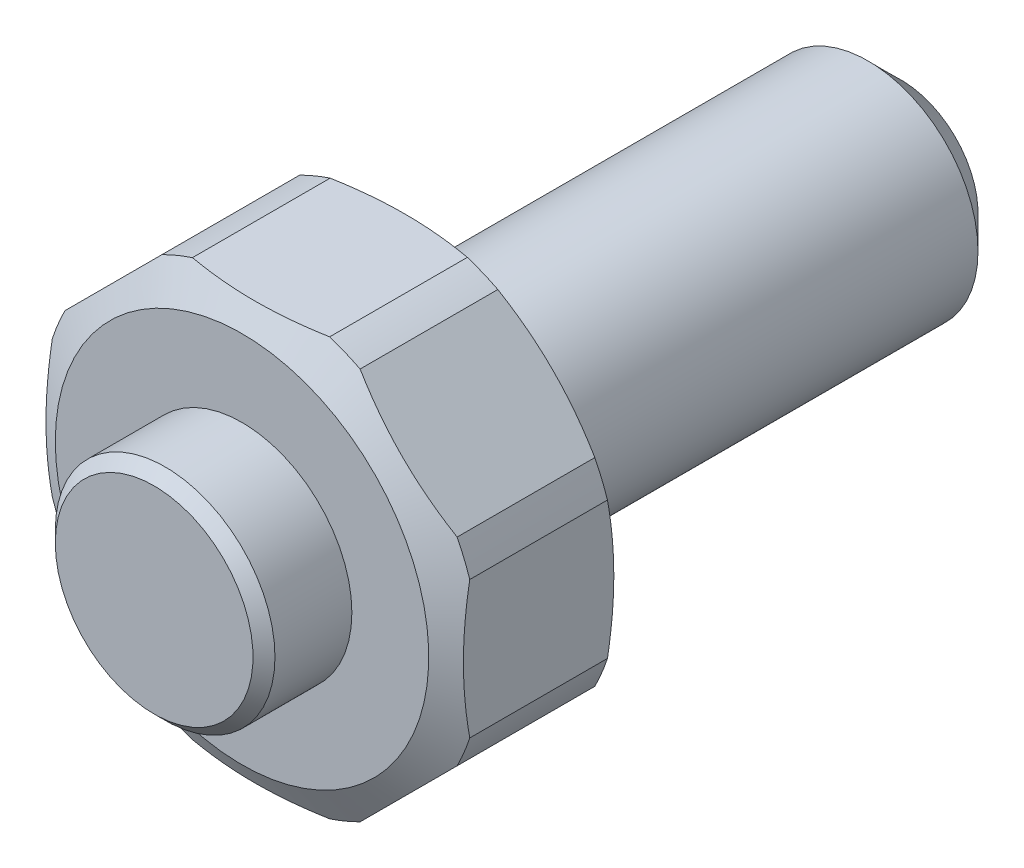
ISO-10303-21;
HEADER;
FILE_DESCRIPTION(('STEP AP214'),'2;1');
FILE_NAME('part.step','',(''),(''),'','','');
FILE_SCHEMA(('AUTOMOTIVE_DESIGN { 1 0 10303 214 1 1 1 1 }'));
ENDSEC;
DATA;
#1=APPLICATION_CONTEXT('core data for automotive mechanical design processes');
#2=APPLICATION_PROTOCOL_DEFINITION('international standard','automotive_design',2000,#1);
#3=PRODUCT_CONTEXT('',#1,'mechanical');
#4=PRODUCT('Part','Part','',(#3));
#5=PRODUCT_RELATED_PRODUCT_CATEGORY('part','',(#4));
#6=PRODUCT_DEFINITION_FORMATION('','',#4);
#7=PRODUCT_DEFINITION_CONTEXT('part definition',#1,'design');
#8=PRODUCT_DEFINITION('design','',#6,#7);
#9=PRODUCT_DEFINITION_SHAPE('','',#8);
#10=(LENGTH_UNIT() NAMED_UNIT(*) SI_UNIT(.MILLI.,.METRE.));
#11=(NAMED_UNIT(*) PLANE_ANGLE_UNIT() SI_UNIT($,.RADIAN.));
#12=(NAMED_UNIT(*) SI_UNIT($,.STERADIAN.) SOLID_ANGLE_UNIT());
#13=UNCERTAINTY_MEASURE_WITH_UNIT(LENGTH_MEASURE(1.E-05),#10,'distance_accuracy_value','');
#14=(GEOMETRIC_REPRESENTATION_CONTEXT(3) GLOBAL_UNCERTAINTY_ASSIGNED_CONTEXT((#13)) GLOBAL_UNIT_ASSIGNED_CONTEXT((#10,
#11,#12)) REPRESENTATION_CONTEXT('',''));
#15=CARTESIAN_POINT('',(0.,0.,0.));
#16=DIRECTION('',(0.,0.,1.));
#17=DIRECTION('',(1.,0.,0.));
#18=AXIS2_PLACEMENT_3D('',#15,#16,#17);
#19=CARTESIAN_POINT('',(0.,0.,33.));
#20=DIRECTION('',(0.,0.,1.));
#21=DIRECTION('',(1.,0.,0.));
#22=AXIS2_PLACEMENT_3D('',#19,#20,#21);
#23=CYLINDRICAL_SURFACE('',#22,5.);
#24=CARTESIAN_POINT('',(0.,0.,-20.5));
#25=DIRECTION('',(0.,0.,-1.));
#26=DIRECTION('',(-1.,0.,0.));
#27=AXIS2_PLACEMENT_3D('',#24,#25,#26);
#28=CIRCLE('',#27,5.);
#29=CARTESIAN_POINT('',(-5.,0.,-20.5));
#30=VERTEX_POINT('',#29);
#31=EDGE_CURVE('E9',#30,#30,#28,.F.);
#32=ORIENTED_EDGE('',*,*,#31,.T.);
#33=EDGE_LOOP('',(#32));
#34=FACE_BOUND('',#33,.T.);
#35=CARTESIAN_POINT('',(0.,0.,0.));
#36=DIRECTION('',(0.,0.,1.));
#37=DIRECTION('',(1.,0.,0.));
#38=AXIS2_PLACEMENT_3D('',#35,#36,#37);
#39=CIRCLE('',#38,5.);
#40=CARTESIAN_POINT('',(5.,0.,0.));
#41=VERTEX_POINT('',#40);
#42=EDGE_CURVE('E349',#41,#41,#39,.T.);
#43=ORIENTED_EDGE('',*,*,#42,.F.);
#44=EDGE_LOOP('',(#43));
#45=FACE_BOUND('',#44,.T.);
#46=ADVANCED_FACE('F14',(#34,#45),#23,.T.);
#47=CARTESIAN_POINT('',(5.,0.,0.));
#48=DIRECTION('',(0.,0.,1.));
#49=DIRECTION('',(1.,0.,0.));
#50=AXIS2_PLACEMENT_3D('',#47,#48,#49);
#51=PLANE('',#50);
#52=ORIENTED_EDGE('',*,*,#42,.T.);
#53=EDGE_LOOP('',(#52));
#54=FACE_BOUND('',#53,.T.);
#55=CARTESIAN_POINT('',(0.,0.,0.));
#56=DIRECTION('',(0.,0.,-1.));
#57=DIRECTION('',(-1.,0.,0.));
#58=AXIS2_PLACEMENT_3D('',#55,#56,#57);
#59=CIRCLE('',#58,8.5);
#60=CARTESIAN_POINT('',(-8.5,0.,0.));
#61=VERTEX_POINT('',#60);
#62=EDGE_CURVE('E424',#61,#61,#59,.T.);
#63=ORIENTED_EDGE('',*,*,#62,.T.);
#64=EDGE_LOOP('',(#63));
#65=FACE_BOUND('',#64,.T.);
#66=ADVANCED_FACE('F319',(#54,#65),#51,.F.);
#67=CARTESIAN_POINT('',(0.,0.,-47.));
#68=DIRECTION('',(0.,0.,-1.));
#69=DIRECTION('',(-1.,0.,0.));
#70=AXIS2_PLACEMENT_3D('',#67,#68,#69);
#71=CYLINDRICAL_SURFACE('',#70,10.);
#72=CARTESIAN_POINT('',(0.,0.,7.1339745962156));
#73=DIRECTION('',(0.,0.,-1.));
#74=DIRECTION('',(-1.,0.,0.));
#75=AXIS2_PLACEMENT_3D('',#72,#73,#74);
#76=CIRCLE('',#75,10.);
#77=CARTESIAN_POINT('',(4.50957420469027,-8.92545463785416,7.1339745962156));
#78=VERTEX_POINT('',#77);
#79=CARTESIAN_POINT('',(3.12249899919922,-9.5,7.1339745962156));
#80=VERTEX_POINT('',#79);
#81=EDGE_CURVE('E432',#78,#80,#76,.T.);
#82=ORIENTED_EDGE('',*,*,#81,.T.);
#83=DIRECTION('',(0.,0.,-1.));
#84=VECTOR('',#83,1.);
#85=CARTESIAN_POINT('',(3.12249899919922,-9.5,-47.));
#86=LINE('',#85,#84);
#87=CARTESIAN_POINT('',(3.12249899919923,-9.5,0.866025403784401));
#88=VERTEX_POINT('',#87);
#89=EDGE_CURVE('E402',#80,#88,#86,.T.);
#90=ORIENTED_EDGE('',*,*,#89,.T.);
#91=CARTESIAN_POINT('',(0.,0.,0.866025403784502));
#92=DIRECTION('',(0.,0.,1.));
#93=DIRECTION('',(1.,0.,0.));
#94=AXIS2_PLACEMENT_3D('',#91,#92,#93);
#95=CIRCLE('',#94,10.);
#96=CARTESIAN_POINT('',(4.50957420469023,-8.92545463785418,0.866025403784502));
#97=VERTEX_POINT('',#96);
#98=EDGE_CURVE('E395',#97,#88,#95,.F.);
#99=ORIENTED_EDGE('',*,*,#98,.F.);
#100=DIRECTION('',(0.,0.,-1.));
#101=VECTOR('',#100,1.);
#102=CARTESIAN_POINT('',(4.50957420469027,-8.92545463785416,-47.));
#103=LINE('',#102,#101);
#104=EDGE_CURVE('E357',#78,#97,#103,.T.);
#105=ORIENTED_EDGE('',*,*,#104,.F.);
#106=EDGE_LOOP('',(#82,#90,#99,#105));
#107=FACE_BOUND('',#106,.T.);
#108=ADVANCED_FACE('F188',(#107),#71,.T.);
#109=CARTESIAN_POINT('',(9.5,-3.12249899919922,0.866025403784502));
#110=VERTEX_POINT('',#109);
#111=CARTESIAN_POINT('',(8.92545463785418,-4.50957420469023,0.866025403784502));
#112=VERTEX_POINT('',#111);
#113=EDGE_CURVE('E29',#110,#112,#95,.F.);
#114=ORIENTED_EDGE('',*,*,#113,.F.);
#115=DIRECTION('',(0.,0.,-1.));
#116=VECTOR('',#115,1.);
#117=CARTESIAN_POINT('',(9.5,-3.12249899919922,-47.));
#118=LINE('',#117,#116);
#119=CARTESIAN_POINT('',(9.5,-3.12249899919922,7.1339745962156));
#120=VERTEX_POINT('',#119);
#121=EDGE_CURVE('E363',#120,#110,#118,.T.);
#122=ORIENTED_EDGE('',*,*,#121,.F.);
#123=CARTESIAN_POINT('',(8.92545463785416,-4.50957420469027,7.1339745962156));
#124=VERTEX_POINT('',#123);
#125=EDGE_CURVE('E435',#120,#124,#76,.T.);
#126=ORIENTED_EDGE('',*,*,#125,.T.);
#127=DIRECTION('',(0.,0.,-1.));
#128=VECTOR('',#127,1.);
#129=CARTESIAN_POINT('',(8.92545463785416,-4.50957420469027,-47.));
#130=LINE('',#129,#128);
#131=EDGE_CURVE('E360',#112,#124,#130,.F.);
#132=ORIENTED_EDGE('',*,*,#131,.F.);
#133=EDGE_LOOP('',(#114,#122,#126,#132));
#134=FACE_BOUND('',#133,.T.);
#135=ADVANCED_FACE('F548',(#134),#71,.T.);
#136=CARTESIAN_POINT('',(8.92545463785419,4.50957420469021,0.866025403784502));
#137=VERTEX_POINT('',#136);
#138=CARTESIAN_POINT('',(9.5,3.12249899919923,0.866025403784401));
#139=VERTEX_POINT('',#138);
#140=EDGE_CURVE('E35',#137,#139,#95,.F.);
#141=ORIENTED_EDGE('',*,*,#140,.F.);
#142=DIRECTION('',(0.,0.,-1.));
#143=VECTOR('',#142,1.);
#144=CARTESIAN_POINT('',(8.92545463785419,4.50957420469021,-47.));
#145=LINE('',#144,#143);
#146=CARTESIAN_POINT('',(8.92545463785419,4.50957420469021,7.1339745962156));
#147=VERTEX_POINT('',#146);
#148=EDGE_CURVE('E369',#147,#137,#145,.T.);
#149=ORIENTED_EDGE('',*,*,#148,.F.);
#150=CARTESIAN_POINT('',(9.5,3.12249899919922,7.1339745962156));
#151=VERTEX_POINT('',#150);
#152=EDGE_CURVE('E436',#147,#151,#76,.T.);
#153=ORIENTED_EDGE('',*,*,#152,.T.);
#154=DIRECTION('',(0.,0.,-1.));
#155=VECTOR('',#154,1.);
#156=CARTESIAN_POINT('',(9.5,3.12249899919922,-47.));
#157=LINE('',#156,#155);
#158=EDGE_CURVE('E366',#139,#151,#157,.F.);
#159=ORIENTED_EDGE('',*,*,#158,.F.);
#160=EDGE_LOOP('',(#141,#149,#153,#159));
#161=FACE_BOUND('',#160,.T.);
#162=ADVANCED_FACE('F554',(#161),#71,.T.);
#163=CARTESIAN_POINT('',(3.12249899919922,9.5,0.866025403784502));
#164=VERTEX_POINT('',#163);
#165=CARTESIAN_POINT('',(4.50957420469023,8.92545463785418,0.866025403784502));
#166=VERTEX_POINT('',#165);
#167=EDGE_CURVE('E420',#164,#166,#95,.F.);
#168=ORIENTED_EDGE('',*,*,#167,.F.);
#169=DIRECTION('',(0.,0.,-1.));
#170=VECTOR('',#169,1.);
#171=CARTESIAN_POINT('',(3.12249899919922,9.5,-47.));
#172=LINE('',#171,#170);
#173=CARTESIAN_POINT('',(3.12249899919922,9.5,7.1339745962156));
#174=VERTEX_POINT('',#173);
#175=EDGE_CURVE('E375',#174,#164,#172,.T.);
#176=ORIENTED_EDGE('',*,*,#175,.F.);
#177=CARTESIAN_POINT('',(4.50957420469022,8.92545463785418,7.1339745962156));
#178=VERTEX_POINT('',#177);
#179=EDGE_CURVE('E635',#174,#178,#76,.T.);
#180=ORIENTED_EDGE('',*,*,#179,.T.);
#181=DIRECTION('',(0.,0.,-1.));
#182=VECTOR('',#181,1.);
#183=CARTESIAN_POINT('',(4.50957420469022,8.92545463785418,-47.));
#184=LINE('',#183,#182);
#185=EDGE_CURVE('E372',#166,#178,#184,.F.);
#186=ORIENTED_EDGE('',*,*,#185,.F.);
#187=EDGE_LOOP('',(#168,#176,#180,#186));
#188=FACE_BOUND('',#187,.T.);
#189=ADVANCED_FACE('F562',(#188),#71,.T.);
#190=CARTESIAN_POINT('',(-4.5095742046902,8.92545463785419,0.866025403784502));
#191=VERTEX_POINT('',#190);
#192=CARTESIAN_POINT('',(-3.12249899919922,9.5,0.866025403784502));
#193=VERTEX_POINT('',#192);
#194=EDGE_CURVE('E414',#191,#193,#95,.F.);
#195=ORIENTED_EDGE('',*,*,#194,.F.);
#196=DIRECTION('',(0.,0.,-1.));
#197=VECTOR('',#196,1.);
#198=CARTESIAN_POINT('',(-4.5095742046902,8.92545463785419,-47.));
#199=LINE('',#198,#197);
#200=CARTESIAN_POINT('',(-4.5095742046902,8.92545463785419,7.1339745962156));
#201=VERTEX_POINT('',#200);
#202=EDGE_CURVE('E381',#201,#191,#199,.T.);
#203=ORIENTED_EDGE('',*,*,#202,.F.);
#204=CARTESIAN_POINT('',(-3.12249899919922,9.5,7.1339745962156));
#205=VERTEX_POINT('',#204);
#206=EDGE_CURVE('E150',#201,#205,#76,.T.);
#207=ORIENTED_EDGE('',*,*,#206,.T.);
#208=DIRECTION('',(0.,0.,-1.));
#209=VECTOR('',#208,1.);
#210=CARTESIAN_POINT('',(-3.12249899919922,9.5,-47.));
#211=LINE('',#210,#209);
#212=EDGE_CURVE('E378',#193,#205,#211,.F.);
#213=ORIENTED_EDGE('',*,*,#212,.F.);
#214=EDGE_LOOP('',(#195,#203,#207,#213));
#215=FACE_BOUND('',#214,.T.);
#216=ADVANCED_FACE('F417',(#215),#71,.T.);
#217=DIRECTION('',(0.,0.,-1.));
#218=VECTOR('',#217,1.);
#219=CARTESIAN_POINT('',(-9.5,-3.12249899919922,-47.));
#220=LINE('',#219,#218);
#221=CARTESIAN_POINT('',(-9.5,-3.12249899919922,7.1339745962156));
#222=VERTEX_POINT('',#221);
#223=CARTESIAN_POINT('',(-9.5,-3.12249899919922,0.866025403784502));
#224=VERTEX_POINT('',#223);
#225=EDGE_CURVE('E137',#222,#224,#220,.T.);
#226=ORIENTED_EDGE('',*,*,#225,.T.);
#227=CARTESIAN_POINT('',(-8.92545463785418,-4.50957420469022,0.866025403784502));
#228=VERTEX_POINT('',#227);
#229=EDGE_CURVE('E421',#228,#224,#95,.F.);
#230=ORIENTED_EDGE('',*,*,#229,.F.);
#231=DIRECTION('',(0.,0.,-1.));
#232=VECTOR('',#231,1.);
#233=CARTESIAN_POINT('',(-8.92545463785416,-4.50957420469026,-47.));
#234=LINE('',#233,#232);
#235=CARTESIAN_POINT('',(-8.92545463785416,-4.50957420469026,7.1339745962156));
#236=VERTEX_POINT('',#235);
#237=EDGE_CURVE('E388',#228,#236,#234,.F.);
#238=ORIENTED_EDGE('',*,*,#237,.T.);
#239=EDGE_CURVE('E152',#236,#222,#76,.T.);
#240=ORIENTED_EDGE('',*,*,#239,.T.);
#241=EDGE_LOOP('',(#226,#230,#238,#240));
#242=FACE_BOUND('',#241,.T.);
#243=ADVANCED_FACE('F438',(#242),#71,.T.);
#244=CARTESIAN_POINT('',(-9.5,3.12249899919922,0.866025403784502));
#245=VERTEX_POINT('',#244);
#246=CARTESIAN_POINT('',(-8.92545463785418,4.50957420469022,0.866025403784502));
#247=VERTEX_POINT('',#246);
#248=EDGE_CURVE('E133',#245,#247,#95,.F.);
#249=ORIENTED_EDGE('',*,*,#248,.F.);
#250=DIRECTION('',(0.,0.,-1.));
#251=VECTOR('',#250,1.);
#252=CARTESIAN_POINT('',(-9.5,3.12249899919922,-47.));
#253=LINE('',#252,#251);
#254=CARTESIAN_POINT('',(-9.5,3.12249899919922,7.1339745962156));
#255=VERTEX_POINT('',#254);
#256=EDGE_CURVE('E127',#245,#255,#253,.F.);
#257=ORIENTED_EDGE('',*,*,#256,.T.);
#258=CARTESIAN_POINT('',(-8.92545463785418,4.50957420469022,7.1339745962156));
#259=VERTEX_POINT('',#258);
#260=EDGE_CURVE('E131',#255,#259,#76,.T.);
#261=ORIENTED_EDGE('',*,*,#260,.T.);
#262=DIRECTION('',(0.,0.,-1.));
#263=VECTOR('',#262,1.);
#264=CARTESIAN_POINT('',(-8.92545463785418,4.50957420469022,-47.));
#265=LINE('',#264,#263);
#266=EDGE_CURVE('E384',#247,#259,#265,.F.);
#267=ORIENTED_EDGE('',*,*,#266,.F.);
#268=EDGE_LOOP('',(#249,#257,#261,#267));
#269=FACE_BOUND('',#268,.T.);
#270=ADVANCED_FACE('F129',(#269),#71,.T.);
#271=DIRECTION('',(0.,0.,-1.));
#272=VECTOR('',#271,1.);
#273=CARTESIAN_POINT('',(-4.50957420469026,-8.92545463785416,-47.));
#274=LINE('',#273,#272);
#275=CARTESIAN_POINT('',(-4.50957420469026,-8.92545463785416,7.1339745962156));
#276=VERTEX_POINT('',#275);
#277=CARTESIAN_POINT('',(-4.50957420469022,-8.92545463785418,0.866025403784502));
#278=VERTEX_POINT('',#277);
#279=EDGE_CURVE('E138',#276,#278,#274,.T.);
#280=ORIENTED_EDGE('',*,*,#279,.T.);
#281=CARTESIAN_POINT('',(-3.12249899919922,-9.5,0.866025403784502));
#282=VERTEX_POINT('',#281);
#283=EDGE_CURVE('E404',#282,#278,#95,.F.);
#284=ORIENTED_EDGE('',*,*,#283,.F.);
#285=DIRECTION('',(0.,0.,-1.));
#286=VECTOR('',#285,1.);
#287=CARTESIAN_POINT('',(-3.12249899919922,-9.5,-47.));
#288=LINE('',#287,#286);
#289=CARTESIAN_POINT('',(-3.12249899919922,-9.5,7.1339745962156));
#290=VERTEX_POINT('',#289);
#291=EDGE_CURVE('E430',#282,#290,#288,.F.);
#292=ORIENTED_EDGE('',*,*,#291,.T.);
#293=EDGE_CURVE('E434',#290,#276,#76,.T.);
#294=ORIENTED_EDGE('',*,*,#293,.T.);
#295=EDGE_LOOP('',(#280,#284,#292,#294));
#296=FACE_BOUND('',#295,.T.);
#297=ADVANCED_FACE('F263',(#296),#71,.T.);
#298=CARTESIAN_POINT('',(0.,0.,1.2519735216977));
#299=DIRECTION('',(0.,0.,1.));
#300=DIRECTION('',(1.,0.,0.));
#301=AXIS2_PLACEMENT_3D('',#298,#299,#300);
#302=CONICAL_SURFACE('',#301,10.6684817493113,1.0471975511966);
#303=CARTESIAN_POINT('',(8.92623897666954,-4.50878986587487,0.866225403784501));
#304=CARTESIAN_POINT('',(8.76725039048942,-4.66777845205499,0.825659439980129));
#305=CARTESIAN_POINT('',(8.60775417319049,-4.82727466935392,0.788950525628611));
#306=CARTESIAN_POINT('',(8.28788818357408,-5.14714065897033,0.723814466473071));
#307=CARTESIAN_POINT('',(8.12751824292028,-5.30751059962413,0.695388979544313));
#308=CARTESIAN_POINT('',(7.80607824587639,-5.62895059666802,0.647399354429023));
#309=CARTESIAN_POINT('',(7.64500805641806,-5.79002078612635,0.627836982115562));
#310=CARTESIAN_POINT('',(7.32244893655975,-6.11257990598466,0.597991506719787));
#311=CARTESIAN_POINT('',(7.16096004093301,-6.2740688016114,0.587707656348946));
#312=CARTESIAN_POINT('',(6.84003571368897,-6.59499312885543,0.576721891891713));
#313=CARTESIAN_POINT('',(6.68060250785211,-6.75442633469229,0.575890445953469));
#314=CARTESIAN_POINT('',(6.3618464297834,-7.073182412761,0.583492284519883));
#315=CARTESIAN_POINT('',(6.20252355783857,-7.23250528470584,0.591925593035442));
#316=CARTESIAN_POINT('',(5.88433570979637,-7.55069313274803,0.617866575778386));
#317=CARTESIAN_POINT('',(5.72547053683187,-7.70955830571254,0.635369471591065));
#318=CARTESIAN_POINT('',(5.40835671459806,-8.02667212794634,0.679082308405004));
#319=CARTESIAN_POINT('',(5.25010799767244,-8.18492084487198,0.705291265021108));
#320=CARTESIAN_POINT('',(5.0435304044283,-8.39149843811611,0.744954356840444));
#321=CARTESIAN_POINT('',(4.99483434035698,-8.44019450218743,0.754702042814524));
#322=CARTESIAN_POINT('',(4.89752615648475,-8.53750268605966,0.774960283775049));
#323=CARTESIAN_POINT('',(4.84891402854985,-8.58611481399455,0.785470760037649));
#324=CARTESIAN_POINT('',(4.75166725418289,-8.68336158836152,0.807261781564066));
#325=CARTESIAN_POINT('',(4.70303279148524,-8.73199605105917,0.818543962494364));
#326=CARTESIAN_POINT('',(4.60584700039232,-8.82918184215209,0.841840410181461));
#327=CARTESIAN_POINT('',(4.55729568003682,-8.87773316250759,0.853854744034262));
#328=CARTESIAN_POINT('',(4.50878986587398,-8.92623897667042,0.866225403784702));
#329=B_SPLINE_CURVE_WITH_KNOTS('',3,(#303,#304,#305,#306,#307,#308,#309,#310,#311,#312,#313,
#314,#315,#316,#317,#318,#319,#320,#321,#322,#323,#324,#325,#326,#327,#328),.UNSPECIFIED.,.F.,
.F.,(4,2,2,2,2,2,2,2,2,2,2,2,4),(0.,0.685420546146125,1.37097818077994,2.05667234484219,
2.74231127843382,3.41854298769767,4.09477644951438,4.77065399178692,5.44645513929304,
5.65511208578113,5.86374752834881,6.07283977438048,6.28195121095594),.UNSPECIFIED.);
#330=EDGE_CURVE('E248',#112,#97,#329,.T.);
#331=ORIENTED_EDGE('',*,*,#330,.T.);
#332=ORIENTED_EDGE('',*,*,#98,.T.);
#333=CARTESIAN_POINT('',(-11.7991337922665,-9.5,3.83837045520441));
#334=CARTESIAN_POINT('',(-11.6196197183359,-9.5,3.75764424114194));
#335=CARTESIAN_POINT('',(-11.4398364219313,-9.5,3.67751717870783));
#336=CARTESIAN_POINT('',(-11.0796807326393,-9.5,3.5185898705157));
#337=CARTESIAN_POINT('',(-10.8993083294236,-9.5,3.43978964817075));
#338=CARTESIAN_POINT('',(-10.3571587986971,-9.5,3.20554074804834));
#339=CARTESIAN_POINT('',(-9.99443096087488,-9.5,3.05228067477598));
#340=CARTESIAN_POINT('',(-9.26387410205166,-9.5,2.75200834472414));
#341=CARTESIAN_POINT('',(-8.89602758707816,-9.5,2.60503851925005));
#342=CARTESIAN_POINT('',(-8.15690987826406,-9.5,2.32000550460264));
#343=CARTESIAN_POINT('',(-7.78563890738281,-9.5,2.18194174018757));
#344=CARTESIAN_POINT('',(-7.04316993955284,-9.5,1.91824605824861));
#345=CARTESIAN_POINT('',(-6.67201393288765,-9.5,1.79249660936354));
#346=CARTESIAN_POINT('',(-5.92539256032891,-9.5,1.55429452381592));
#347=CARTESIAN_POINT('',(-5.5499268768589,-9.5,1.441842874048));
#348=CARTESIAN_POINT('',(-4.79528025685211,-9.5,1.23350959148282));
#349=CARTESIAN_POINT('',(-4.41610937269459,-9.5,1.13759186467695));
#350=CARTESIAN_POINT('',(-3.65333357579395,-9.5,0.965449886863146));
#351=CARTESIAN_POINT('',(-3.26972975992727,-9.5,0.889220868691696));
#352=CARTESIAN_POINT('',(-2.66208882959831,-9.5,0.787300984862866));
#353=CARTESIAN_POINT('',(-2.43933466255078,-9.5,0.753884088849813));
#354=CARTESIAN_POINT('',(-1.99274850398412,-9.5,0.695313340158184));
#355=CARTESIAN_POINT('',(-1.76891659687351,-9.5,0.670158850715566));
#356=CARTESIAN_POINT('',(-1.32040221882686,-9.5,0.628600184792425));
#357=CARTESIAN_POINT('',(-1.09571961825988,-9.5,0.612197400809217));
#358=CARTESIAN_POINT('',(-0.645869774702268,-9.5,0.588490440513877));
#359=CARTESIAN_POINT('',(-0.420702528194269,-9.5,0.581186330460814));
#360=CARTESIAN_POINT('',(0.0299682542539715,-9.5,0.575833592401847));
#361=CARTESIAN_POINT('',(0.255471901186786,-9.5,0.5777942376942));
#362=CARTESIAN_POINT('',(0.706205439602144,-9.5,0.590948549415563));
#363=CARTESIAN_POINT('',(0.931435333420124,-9.5,0.602142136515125));
#364=CARTESIAN_POINT('',(1.38119404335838,-9.5,0.63351797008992));
#365=CARTESIAN_POINT('',(1.60572305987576,-9.5,0.653697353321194));
#366=CARTESIAN_POINT('',(2.05385286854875,-9.5,0.70262815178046));
#367=CARTESIAN_POINT('',(2.27745357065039,-9.5,0.73138037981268));
#368=CARTESIAN_POINT('',(2.97093135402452,-9.5,0.833304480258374));
#369=CARTESIAN_POINT('',(3.43880776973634,-9.5,0.920366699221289));
#370=CARTESIAN_POINT('',(4.36807181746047,-9.5,1.12423701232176));
#371=CARTESIAN_POINT('',(4.82945621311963,-9.5,1.24105942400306));
#372=CARTESIAN_POINT('',(5.74730092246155,-9.5,1.49876979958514));
#373=CARTESIAN_POINT('',(6.20373520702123,-9.5,1.63974931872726));
#374=CARTESIAN_POINT('',(7.11035554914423,-9.5,1.94013357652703));
#375=CARTESIAN_POINT('',(7.56054247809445,-9.5,2.09953571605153));
#376=CARTESIAN_POINT('',(8.46087603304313,-9.5,2.43456119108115));
#377=CARTESIAN_POINT('',(8.910958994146,-9.5,2.61035433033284));
#378=CARTESIAN_POINT('',(9.80656288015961,-9.5,2.97323675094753));
#379=CARTESIAN_POINT('',(10.2520834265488,-9.5,3.16032696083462));
#380=CARTESIAN_POINT('',(11.1349942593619,-9.5,3.54144819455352));
#381=CARTESIAN_POINT('',(11.5724214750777,-9.5,3.73539398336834));
#382=CARTESIAN_POINT('',(12.2261672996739,-9.5,4.03140711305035));
#383=CARTESIAN_POINT('',(12.4436522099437,-9.5,4.1309125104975));
#384=CARTESIAN_POINT('',(12.8779098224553,-9.5,4.33145496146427));
#385=CARTESIAN_POINT('',(13.0946825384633,-9.5,4.43249198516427));
#386=CARTESIAN_POINT('',(13.3111357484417,-9.5,4.5342092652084));
#387=B_SPLINE_CURVE_WITH_KNOTS('',3,(#333,#334,#335,#336,#337,#338,#339,#340,#341,#342,#343,
#344,#345,#346,#347,#348,#349,#350,#351,#352,#353,#354,#355,#356,#357,#358,#359,#360,#361,#362,
#363,#364,#365,#366,#367,#368,#369,#370,#371,#372,#373,#374,#375,#376,#377,#378,#379,#380,#381,
#382,#383,#384,#385,#386),.UNSPECIFIED.,.F.,.F.,(4,2,2,2,2,2,2,2,2,2,2,2,2,2,2,2,2,2,2,2,2,2,2,
2,2,2,4),(0.,0.590487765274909,1.1809859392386,2.3622508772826,3.5505196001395,4.73871149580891,
5.91414991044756,7.08967550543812,8.26260147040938,9.43524317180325,10.1108513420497,
10.7864074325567,11.4620709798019,12.1377394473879,12.8140843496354,13.4904234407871,
14.1665471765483,14.8427350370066,16.2691371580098,17.6962268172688,19.1288498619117,
20.5612710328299,22.0106625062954,23.4601732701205,24.8955818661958,25.6130792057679,
26.3305625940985),.UNSPECIFIED.);
#388=EDGE_CURVE('E268',#282,#88,#387,.T.);
#389=ORIENTED_EDGE('',*,*,#388,.F.);
#390=ORIENTED_EDGE('',*,*,#283,.T.);
#391=CARTESIAN_POINT('',(-8.92623897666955,-4.50878986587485,0.866225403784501));
#392=CARTESIAN_POINT('',(-8.76725039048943,-4.66777845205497,0.82565943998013));
#393=CARTESIAN_POINT('',(-8.60775417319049,-4.8272746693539,0.788950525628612));
#394=CARTESIAN_POINT('',(-8.28788818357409,-5.14714065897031,0.723814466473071));
#395=CARTESIAN_POINT('',(-8.12751824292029,-5.30751059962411,0.695388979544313));
#396=CARTESIAN_POINT('',(-7.8060782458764,-5.628950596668,0.647399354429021));
#397=CARTESIAN_POINT('',(-7.64500805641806,-5.79002078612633,0.627836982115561));
#398=CARTESIAN_POINT('',(-7.32244893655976,-6.11257990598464,0.597991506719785));
#399=CARTESIAN_POINT('',(-7.16096004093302,-6.27406880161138,0.587707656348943));
#400=CARTESIAN_POINT('',(-6.84003571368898,-6.59499312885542,0.576721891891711));
#401=CARTESIAN_POINT('',(-6.68060250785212,-6.75442633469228,0.575890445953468));
#402=CARTESIAN_POINT('',(-6.36184642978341,-7.07318241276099,0.583492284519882));
#403=CARTESIAN_POINT('',(-6.20252355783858,-7.23250528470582,0.591925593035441));
#404=CARTESIAN_POINT('',(-5.88433570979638,-7.55069313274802,0.617866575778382));
#405=CARTESIAN_POINT('',(-5.72547053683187,-7.70955830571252,0.635369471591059));
#406=CARTESIAN_POINT('',(-5.40835671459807,-8.02667212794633,0.679082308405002));
#407=CARTESIAN_POINT('',(-5.25010799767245,-8.18492084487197,0.705291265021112));
#408=CARTESIAN_POINT('',(-5.04353040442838,-8.39149843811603,0.744954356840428));
#409=CARTESIAN_POINT('',(-4.99483434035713,-8.44019450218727,0.754702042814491));
#410=CARTESIAN_POINT('',(-4.89752615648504,-8.53750268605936,0.774960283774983));
#411=CARTESIAN_POINT('',(-4.84891402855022,-8.58611481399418,0.785470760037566));
#412=CARTESIAN_POINT('',(-4.75166725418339,-8.68336158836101,0.807261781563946));
#413=CARTESIAN_POINT('',(-4.70303279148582,-8.73199605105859,0.818543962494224));
#414=CARTESIAN_POINT('',(-4.60584700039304,-8.82918184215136,0.841840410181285));
#415=CARTESIAN_POINT('',(-4.55729568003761,-8.87773316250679,0.853854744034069));
#416=CARTESIAN_POINT('',(-4.50878986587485,-8.92623897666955,0.866225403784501));
#417=B_SPLINE_CURVE_WITH_KNOTS('',3,(#391,#392,#393,#394,#395,#396,#397,#398,#399,#400,#401,
#402,#403,#404,#405,#406,#407,#408,#409,#410,#411,#412,#413,#414,#415,#416),.UNSPECIFIED.,.F.,
.F.,(4,2,2,2,2,2,2,2,2,2,2,2,4),(0.,0.685420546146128,1.37097818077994,2.0566723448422,
2.74231127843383,3.41854298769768,4.09477644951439,4.77065399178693,5.44645513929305,
5.65511208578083,5.86374752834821,6.07283977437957,6.28195121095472),.UNSPECIFIED.);
#418=EDGE_CURVE('E277',#228,#278,#417,.T.);
#419=ORIENTED_EDGE('',*,*,#418,.F.);
#420=ORIENTED_EDGE('',*,*,#229,.T.);
#421=CARTESIAN_POINT('',(-9.5,-11.7991337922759,3.8383704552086));
#422=CARTESIAN_POINT('',(-9.5,-11.6196197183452,3.75764424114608));
#423=CARTESIAN_POINT('',(-9.50000000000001,-11.4398364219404,3.67751717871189));
#424=CARTESIAN_POINT('',(-9.50000000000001,-11.0796807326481,3.51858987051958));
#425=CARTESIAN_POINT('',(-9.50000000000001,-10.8993083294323,3.43978964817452));
#426=CARTESIAN_POINT('',(-9.50000000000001,-10.3571587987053,3.20554074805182));
#427=CARTESIAN_POINT('',(-9.50000000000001,-9.99443096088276,3.05228067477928));
#428=CARTESIAN_POINT('',(-9.50000000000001,-9.26387410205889,2.75200834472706));
#429=CARTESIAN_POINT('',(-9.50000000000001,-8.89602758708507,2.60503851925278));
#430=CARTESIAN_POINT('',(-9.50000000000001,-8.15690987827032,2.32000550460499));
#431=CARTESIAN_POINT('',(-9.50000000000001,-7.78563890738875,2.18194174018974));
#432=CARTESIAN_POINT('',(-9.50000000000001,-7.04316993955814,1.91824605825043));
#433=CARTESIAN_POINT('',(-9.50000000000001,-6.67201393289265,1.7924966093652));
#434=CARTESIAN_POINT('',(-9.50000000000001,-5.92539256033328,1.55429452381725));
#435=CARTESIAN_POINT('',(-9.5,-5.54992687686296,1.44184287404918));
#436=CARTESIAN_POINT('',(-9.5,-4.79528025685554,1.23350959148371));
#437=CARTESIAN_POINT('',(-9.50000000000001,-4.41610937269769,1.1375918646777));
#438=CARTESIAN_POINT('',(-9.5,-3.65333357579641,0.965449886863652));
#439=CARTESIAN_POINT('',(-9.5,-3.2697297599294,0.889220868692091));
#440=CARTESIAN_POINT('',(-9.5,-2.66208882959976,0.787300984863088));
#441=CARTESIAN_POINT('',(-9.5,-2.43933466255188,0.753884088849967));
#442=CARTESIAN_POINT('',(-9.5,-1.99274850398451,0.695313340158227));
#443=CARTESIAN_POINT('',(-9.5,-1.76891659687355,0.670158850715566));
#444=CARTESIAN_POINT('',(-9.5,-1.32040221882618,0.628600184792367));
#445=CARTESIAN_POINT('',(-9.5,-1.09571961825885,0.612197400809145));
#446=CARTESIAN_POINT('',(-9.5,-0.645869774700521,0.588490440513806));
#447=CARTESIAN_POINT('',(-9.5,-0.420702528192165,0.581186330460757));
#448=CARTESIAN_POINT('',(-9.5,0.0299682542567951,0.575833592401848));
#449=CARTESIAN_POINT('',(-9.5,0.25547190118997,0.577794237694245));
#450=CARTESIAN_POINT('',(-9.5,0.706205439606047,0.590948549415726));
#451=CARTESIAN_POINT('',(-9.5,0.931435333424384,0.602142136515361));
#452=CARTESIAN_POINT('',(-9.5,1.38119404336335,0.633517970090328));
#453=CARTESIAN_POINT('',(-9.5,1.60572305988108,0.6536973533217));
#454=CARTESIAN_POINT('',(-9.5,2.05385286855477,0.702628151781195));
#455=CARTESIAN_POINT('',(-9.5,2.27745357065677,0.731380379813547));
#456=CARTESIAN_POINT('',(-9.5,2.97093135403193,0.833304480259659));
#457=CARTESIAN_POINT('',(-9.5,3.43880776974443,0.920366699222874));
#458=CARTESIAN_POINT('',(-9.5,4.3680718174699,1.12423701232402));
#459=CARTESIAN_POINT('',(-9.5,4.82945621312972,1.24105942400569));
#460=CARTESIAN_POINT('',(-9.5,5.74730092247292,1.49876979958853));
#461=CARTESIAN_POINT('',(-9.5,6.20373520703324,1.63974931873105));
#462=CARTESIAN_POINT('',(-9.5,7.11035554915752,1.94013357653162));
#463=CARTESIAN_POINT('',(-9.5,7.56054247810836,2.09953571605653));
#464=CARTESIAN_POINT('',(-9.5,8.46087603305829,2.43456119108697));
#465=CARTESIAN_POINT('',(-9.5,8.91095899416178,2.61035433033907));
#466=CARTESIAN_POINT('',(-9.5,9.80656288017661,2.97323675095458));
#467=CARTESIAN_POINT('',(-9.5,10.2520834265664,3.16032696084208));
#468=CARTESIAN_POINT('',(-9.5,11.1349942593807,3.54144819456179));
#469=CARTESIAN_POINT('',(-9.5,11.5724214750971,3.73539398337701));
#470=CARTESIAN_POINT('',(-9.5,12.2261672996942,4.03140711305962));
#471=CARTESIAN_POINT('',(-9.5,12.4436522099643,4.13091251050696));
#472=CARTESIAN_POINT('',(-9.5,12.8779098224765,4.33145496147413));
#473=CARTESIAN_POINT('',(-9.5,13.0946825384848,4.43249198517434));
#474=CARTESIAN_POINT('',(-9.5,13.3111357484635,4.5342092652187));
#475=B_SPLINE_CURVE_WITH_KNOTS('',3,(#421,#422,#423,#424,#425,#426,#427,#428,#429,#430,#431,
#432,#433,#434,#435,#436,#437,#438,#439,#440,#441,#442,#443,#444,#445,#446,#447,#448,#449,#450,
#451,#452,#453,#454,#455,#456,#457,#458,#459,#460,#461,#462,#463,#464,#465,#466,#467,#468,#469,
#470,#471,#472,#473,#474),.UNSPECIFIED.,.F.,.F.,(4,2,2,2,2,2,2,2,2,2,2,2,2,2,2,2,2,2,2,2,2,2,2,
2,2,2,4),(0.,0.590487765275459,1.1809859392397,2.3622508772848,3.55051960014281,
4.73871149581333,5.91414991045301,7.08967550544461,8.26260147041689,9.43524317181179,
10.1108513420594,10.7864074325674,11.4620709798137,12.1377394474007,12.8140843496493,
13.4904234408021,14.1665471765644,14.8427350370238,16.2691371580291,17.6962268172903,
19.1288498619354,20.5612710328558,22.0106625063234,23.4601732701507,24.8955818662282,
25.6130792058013,26.3305625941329),.UNSPECIFIED.);
#476=EDGE_CURVE('E284',#245,#224,#475,.F.);
#477=ORIENTED_EDGE('',*,*,#476,.F.);
#478=ORIENTED_EDGE('',*,*,#248,.T.);
#479=CARTESIAN_POINT('',(-8.92623897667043,4.50878986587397,0.866225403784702));
#480=CARTESIAN_POINT('',(-8.76725039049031,4.66777845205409,0.825659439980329));
#481=CARTESIAN_POINT('',(-8.60775417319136,4.82727466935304,0.7889505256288));
#482=CARTESIAN_POINT('',(-8.28788818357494,5.14714065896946,0.723814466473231));
#483=CARTESIAN_POINT('',(-8.12751824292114,5.30751059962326,0.695388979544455));
#484=CARTESIAN_POINT('',(-7.80607824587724,5.62895059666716,0.64739935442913));
#485=CARTESIAN_POINT('',(-7.6450080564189,5.79002078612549,0.627836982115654));
#486=CARTESIAN_POINT('',(-7.32244893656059,6.11257990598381,0.597991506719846));
#487=CARTESIAN_POINT('',(-7.16096004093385,6.27406880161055,0.587707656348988));
#488=CARTESIAN_POINT('',(-6.8400357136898,6.5949931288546,0.576721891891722));
#489=CARTESIAN_POINT('',(-6.68060250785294,6.75442633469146,0.575890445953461));
#490=CARTESIAN_POINT('',(-6.36184642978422,7.07318241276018,0.583492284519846));
#491=CARTESIAN_POINT('',(-6.20252355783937,7.23250528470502,0.591925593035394));
#492=CARTESIAN_POINT('',(-5.88433570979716,7.55069313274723,0.617866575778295));
#493=CARTESIAN_POINT('',(-5.72547053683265,7.70955830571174,0.635369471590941));
#494=CARTESIAN_POINT('',(-5.40835671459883,8.02667212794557,0.679082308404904));
#495=CARTESIAN_POINT('',(-5.2501079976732,8.18492084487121,0.705291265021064));
#496=CARTESIAN_POINT('',(-5.04353040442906,8.39149843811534,0.744954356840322));
#497=CARTESIAN_POINT('',(-4.99483434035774,8.44019450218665,0.754702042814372));
#498=CARTESIAN_POINT('',(-4.89752615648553,8.53750268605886,0.774960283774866));
#499=CARTESIAN_POINT('',(-4.84891402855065,8.58611481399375,0.785470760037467));
#500=CARTESIAN_POINT('',(-4.7516672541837,8.6833615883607,0.807261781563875));
#501=CARTESIAN_POINT('',(-4.70303279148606,8.73199605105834,0.818543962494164));
#502=CARTESIAN_POINT('',(-4.60584700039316,8.82918184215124,0.841840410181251));
#503=CARTESIAN_POINT('',(-4.55729568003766,8.87773316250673,0.85385474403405));
#504=CARTESIAN_POINT('',(-4.50878986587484,8.92623897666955,0.866225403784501));
#505=B_SPLINE_CURVE_WITH_KNOTS('',3,(#479,#480,#481,#482,#483,#484,#485,#486,#487,#488,#489,
#490,#491,#492,#493,#494,#495,#496,#497,#498,#499,#500,#501,#502,#503,#504),.UNSPECIFIED.,.F.,
.F.,(4,2,2,2,2,2,2,2,2,2,2,2,4),(0.,0.685420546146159,1.37097818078,2.05667234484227,
2.74231127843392,3.41854298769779,4.09477644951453,4.7706539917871,5.44645513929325,
5.65511208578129,5.86374752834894,6.07283977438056,6.28195121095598),.UNSPECIFIED.);
#506=EDGE_CURVE('E291',#247,#191,#505,.T.);
#507=ORIENTED_EDGE('',*,*,#506,.T.);
#508=ORIENTED_EDGE('',*,*,#194,.T.);
#509=CARTESIAN_POINT('',(-11.7991337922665,9.5,3.83837045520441));
#510=CARTESIAN_POINT('',(-11.6196197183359,9.5,3.75764424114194));
#511=CARTESIAN_POINT('',(-11.4398364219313,9.5,3.67751717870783));
#512=CARTESIAN_POINT('',(-11.0796807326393,9.5,3.5185898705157));
#513=CARTESIAN_POINT('',(-10.8993083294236,9.5,3.43978964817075));
#514=CARTESIAN_POINT('',(-10.3571587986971,9.5,3.20554074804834));
#515=CARTESIAN_POINT('',(-9.99443096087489,9.5,3.05228067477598));
#516=CARTESIAN_POINT('',(-9.26387410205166,9.5,2.75200834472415));
#517=CARTESIAN_POINT('',(-8.89602758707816,9.5,2.60503851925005));
#518=CARTESIAN_POINT('',(-8.15690987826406,9.5,2.32000550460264));
#519=CARTESIAN_POINT('',(-7.78563890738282,9.5,2.18194174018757));
#520=CARTESIAN_POINT('',(-7.04316993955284,9.5,1.91824605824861));
#521=CARTESIAN_POINT('',(-6.67201393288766,9.5,1.79249660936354));
#522=CARTESIAN_POINT('',(-5.92539256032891,9.5,1.55429452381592));
#523=CARTESIAN_POINT('',(-5.5499268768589,9.5,1.441842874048));
#524=CARTESIAN_POINT('',(-4.79528025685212,9.5,1.23350959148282));
#525=CARTESIAN_POINT('',(-4.41610937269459,9.5,1.13759186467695));
#526=CARTESIAN_POINT('',(-3.65333357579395,9.5,0.965449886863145));
#527=CARTESIAN_POINT('',(-3.26972975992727,9.5,0.889220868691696));
#528=CARTESIAN_POINT('',(-2.66208882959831,9.5,0.787300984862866));
#529=CARTESIAN_POINT('',(-2.43933466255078,9.5,0.753884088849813));
#530=CARTESIAN_POINT('',(-1.99274850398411,9.5,0.695313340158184));
#531=CARTESIAN_POINT('',(-1.76891659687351,9.5,0.670158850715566));
#532=CARTESIAN_POINT('',(-1.32040221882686,9.5,0.628600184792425));
#533=CARTESIAN_POINT('',(-1.09571961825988,9.5,0.612197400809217));
#534=CARTESIAN_POINT('',(-0.645869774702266,9.5,0.588490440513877));
#535=CARTESIAN_POINT('',(-0.420702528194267,9.5,0.581186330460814));
#536=CARTESIAN_POINT('',(0.0299682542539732,9.5,0.575833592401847));
#537=CARTESIAN_POINT('',(0.255471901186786,9.5,0.5777942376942));
#538=CARTESIAN_POINT('',(0.706205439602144,9.5,0.590948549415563));
#539=CARTESIAN_POINT('',(0.931435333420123,9.5,0.602142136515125));
#540=CARTESIAN_POINT('',(1.38119404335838,9.5,0.63351797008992));
#541=CARTESIAN_POINT('',(1.60572305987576,9.5,0.653697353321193));
#542=CARTESIAN_POINT('',(2.05385286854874,9.5,0.70262815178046));
#543=CARTESIAN_POINT('',(2.27745357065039,9.5,0.73138037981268));
#544=CARTESIAN_POINT('',(2.97093135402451,9.5,0.833304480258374));
#545=CARTESIAN_POINT('',(3.43880776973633,9.5,0.920366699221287));
#546=CARTESIAN_POINT('',(4.36807181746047,9.5,1.12423701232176));
#547=CARTESIAN_POINT('',(4.82945621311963,9.5,1.24105942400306));
#548=CARTESIAN_POINT('',(5.74730092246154,9.5,1.49876979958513));
#549=CARTESIAN_POINT('',(6.20373520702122,9.5,1.63974931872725));
#550=CARTESIAN_POINT('',(7.11035554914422,9.5,1.94013357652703));
#551=CARTESIAN_POINT('',(7.56054247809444,9.5,2.09953571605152));
#552=CARTESIAN_POINT('',(8.46087603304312,9.5,2.43456119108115));
#553=CARTESIAN_POINT('',(8.91095899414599,9.5,2.61035433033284));
#554=CARTESIAN_POINT('',(9.8065628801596,9.5,2.97323675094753));
#555=CARTESIAN_POINT('',(10.2520834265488,9.5,3.16032696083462));
#556=CARTESIAN_POINT('',(11.1349942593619,9.5,3.54144819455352));
#557=CARTESIAN_POINT('',(11.5724214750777,9.5,3.73539398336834));
#558=CARTESIAN_POINT('',(12.2261672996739,9.5,4.03140711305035));
#559=CARTESIAN_POINT('',(12.4436522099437,9.5,4.1309125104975));
#560=CARTESIAN_POINT('',(12.8779098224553,9.5,4.33145496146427));
#561=CARTESIAN_POINT('',(13.0946825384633,9.5,4.43249198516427));
#562=CARTESIAN_POINT('',(13.3111357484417,9.5,4.5342092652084));
#563=B_SPLINE_CURVE_WITH_KNOTS('',3,(#509,#510,#511,#512,#513,#514,#515,#516,#517,#518,#519,
#520,#521,#522,#523,#524,#525,#526,#527,#528,#529,#530,#531,#532,#533,#534,#535,#536,#537,#538,
#539,#540,#541,#542,#543,#544,#545,#546,#547,#548,#549,#550,#551,#552,#553,#554,#555,#556,#557,
#558,#559,#560,#561,#562),.UNSPECIFIED.,.F.,.F.,(4,2,2,2,2,2,2,2,2,2,2,2,2,2,2,2,2,2,2,2,2,2,2,
2,2,2,4),(0.,0.590487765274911,1.1809859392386,2.3622508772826,3.5505196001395,4.7387114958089,
5.91414991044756,7.08967550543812,8.26260147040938,9.43524317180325,10.1108513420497,
10.7864074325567,11.4620709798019,12.1377394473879,12.8140843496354,13.4904234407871,
14.1665471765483,14.8427350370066,16.2691371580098,17.6962268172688,19.1288498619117,
20.5612710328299,22.0106625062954,23.4601732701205,24.8955818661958,25.6130792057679,
26.3305625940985),.UNSPECIFIED.);
#564=EDGE_CURVE('E297',#193,#164,#563,.T.);
#565=ORIENTED_EDGE('',*,*,#564,.T.);
#566=ORIENTED_EDGE('',*,*,#167,.T.);
#567=CARTESIAN_POINT('',(4.50878986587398,8.92623897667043,0.866225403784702));
#568=CARTESIAN_POINT('',(4.6677784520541,8.7672503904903,0.82565943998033));
#569=CARTESIAN_POINT('',(4.82727466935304,8.60775417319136,0.788950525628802));
#570=CARTESIAN_POINT('',(5.14714065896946,8.28788818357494,0.723814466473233));
#571=CARTESIAN_POINT('',(5.30751059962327,8.12751824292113,0.695388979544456));
#572=CARTESIAN_POINT('',(5.62895059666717,7.80607824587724,0.647399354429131));
#573=CARTESIAN_POINT('',(5.7900207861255,7.6450080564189,0.627836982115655));
#574=CARTESIAN_POINT('',(6.11257990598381,7.32244893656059,0.597991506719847));
#575=CARTESIAN_POINT('',(6.27406880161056,7.16096004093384,0.58770765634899));
#576=CARTESIAN_POINT('',(6.59499312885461,6.84003571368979,0.576721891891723));
#577=CARTESIAN_POINT('',(6.75442633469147,6.68060250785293,0.575890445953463));
#578=CARTESIAN_POINT('',(7.07318241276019,6.36184642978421,0.583492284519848));
#579=CARTESIAN_POINT('',(7.23250528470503,6.20252355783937,0.591925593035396));
#580=CARTESIAN_POINT('',(7.55069313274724,5.88433570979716,0.617866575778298));
#581=CARTESIAN_POINT('',(7.70955830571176,5.72547053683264,0.635369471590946));
#582=CARTESIAN_POINT('',(8.02667212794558,5.40835671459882,0.679082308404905));
#583=CARTESIAN_POINT('',(8.18492084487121,5.25010799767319,0.705291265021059));
#584=CARTESIAN_POINT('',(8.39149843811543,5.04353040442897,0.744954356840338));
#585=CARTESIAN_POINT('',(8.44019450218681,4.99483434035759,0.754702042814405));
#586=CARTESIAN_POINT('',(8.53750268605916,4.89752615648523,0.774960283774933));
#587=CARTESIAN_POINT('',(8.58611481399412,4.84891402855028,0.785470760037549));
#588=CARTESIAN_POINT('',(8.68336158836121,4.75166725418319,0.807261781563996));
#589=CARTESIAN_POINT('',(8.73199605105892,4.70303279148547,0.818543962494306));
#590=CARTESIAN_POINT('',(8.82918184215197,4.60584700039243,0.84184041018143));
#591=CARTESIAN_POINT('',(8.87773316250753,4.55729568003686,0.853854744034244));
#592=CARTESIAN_POINT('',(8.92623897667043,4.50878986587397,0.866225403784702));
#593=B_SPLINE_CURVE_WITH_KNOTS('',3,(#567,#568,#569,#570,#571,#572,#573,#574,#575,#576,#577,
#578,#579,#580,#581,#582,#583,#584,#585,#586,#587,#588,#589,#590,#591,#592),.UNSPECIFIED.,.F.,
.F.,(4,2,2,2,2,2,2,2,2,2,2,2,4),(0.,0.685420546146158,1.37097818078,2.05667234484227,
2.74231127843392,3.4185429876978,4.09477644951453,4.7706539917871,5.44645513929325,
5.65511208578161,5.86374752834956,6.0728397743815,6.28195121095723),.UNSPECIFIED.);
#594=EDGE_CURVE('E249',#166,#137,#593,.T.);
#595=ORIENTED_EDGE('',*,*,#594,.T.);
#596=ORIENTED_EDGE('',*,*,#140,.T.);
#597=CARTESIAN_POINT('',(9.5,-11.7991337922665,3.83837045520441));
#598=CARTESIAN_POINT('',(9.5,-11.6196197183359,3.75764424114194));
#599=CARTESIAN_POINT('',(9.5,-11.4398364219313,3.67751717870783));
#600=CARTESIAN_POINT('',(9.5,-11.0796807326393,3.5185898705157));
#601=CARTESIAN_POINT('',(9.5,-10.8993083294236,3.43978964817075));
#602=CARTESIAN_POINT('',(9.5,-10.3571587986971,3.20554074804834));
#603=CARTESIAN_POINT('',(9.5,-9.99443096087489,3.05228067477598));
#604=CARTESIAN_POINT('',(9.5,-9.26387410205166,2.75200834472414));
#605=CARTESIAN_POINT('',(9.5,-8.89602758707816,2.60503851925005));
#606=CARTESIAN_POINT('',(9.5,-8.15690987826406,2.32000550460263));
#607=CARTESIAN_POINT('',(9.5,-7.78563890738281,2.18194174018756));
#608=CARTESIAN_POINT('',(9.5,-7.04316993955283,1.9182460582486));
#609=CARTESIAN_POINT('',(9.5,-6.67201393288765,1.79249660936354));
#610=CARTESIAN_POINT('',(9.5,-5.9253925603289,1.55429452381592));
#611=CARTESIAN_POINT('',(9.5,-5.5499268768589,1.441842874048));
#612=CARTESIAN_POINT('',(9.5,-4.79528025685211,1.23350959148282));
#613=CARTESIAN_POINT('',(9.5,-4.41610937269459,1.13759186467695));
#614=CARTESIAN_POINT('',(9.5,-3.65333357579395,0.965449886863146));
#615=CARTESIAN_POINT('',(9.5,-3.26972975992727,0.889220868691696));
#616=CARTESIAN_POINT('',(9.5,-2.66208882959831,0.787300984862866));
#617=CARTESIAN_POINT('',(9.5,-2.43933466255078,0.753884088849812));
#618=CARTESIAN_POINT('',(9.5,-1.99274850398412,0.695313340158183));
#619=CARTESIAN_POINT('',(9.5,-1.76891659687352,0.670158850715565));
#620=CARTESIAN_POINT('',(9.5,-1.32040221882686,0.628600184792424));
#621=CARTESIAN_POINT('',(9.5,-1.09571961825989,0.612197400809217));
#622=CARTESIAN_POINT('',(9.5,-0.645869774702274,0.588490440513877));
#623=CARTESIAN_POINT('',(9.5,-0.420702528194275,0.581186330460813));
#624=CARTESIAN_POINT('',(9.5,0.0299682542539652,0.575833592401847));
#625=CARTESIAN_POINT('',(9.5,0.255471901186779,0.577794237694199));
#626=CARTESIAN_POINT('',(9.5,0.706205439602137,0.590948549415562));
#627=CARTESIAN_POINT('',(9.5,0.931435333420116,0.602142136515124));
#628=CARTESIAN_POINT('',(9.5,1.38119404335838,0.633517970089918));
#629=CARTESIAN_POINT('',(9.5,1.60572305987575,0.653697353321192));
#630=CARTESIAN_POINT('',(9.5,2.05385286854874,0.702628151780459));
#631=CARTESIAN_POINT('',(9.5,2.27745357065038,0.73138037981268));
#632=CARTESIAN_POINT('',(9.5,2.97093135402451,0.833304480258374));
#633=CARTESIAN_POINT('',(9.5,3.43880776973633,0.920366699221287));
#634=CARTESIAN_POINT('',(9.5,4.36807181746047,1.12423701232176));
#635=CARTESIAN_POINT('',(9.5,4.82945621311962,1.24105942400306));
#636=CARTESIAN_POINT('',(9.5,5.74730092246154,1.49876979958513));
#637=CARTESIAN_POINT('',(9.5,6.20373520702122,1.63974931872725));
#638=CARTESIAN_POINT('',(9.5,7.11035554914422,1.94013357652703));
#639=CARTESIAN_POINT('',(9.5,7.56054247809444,2.09953571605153));
#640=CARTESIAN_POINT('',(9.5,8.46087603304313,2.43456119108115));
#641=CARTESIAN_POINT('',(9.5,8.910958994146,2.61035433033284));
#642=CARTESIAN_POINT('',(9.5,9.80656288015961,2.97323675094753));
#643=CARTESIAN_POINT('',(9.5,10.2520834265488,3.16032696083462));
#644=CARTESIAN_POINT('',(9.5,11.1349942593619,3.54144819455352));
#645=CARTESIAN_POINT('',(9.5,11.5724214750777,3.73539398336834));
#646=CARTESIAN_POINT('',(9.5,12.2261672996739,4.03140711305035));
#647=CARTESIAN_POINT('',(9.5,12.4436522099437,4.1309125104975));
#648=CARTESIAN_POINT('',(9.5,12.8779098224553,4.33145496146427));
#649=CARTESIAN_POINT('',(9.5,13.0946825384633,4.43249198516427));
#650=CARTESIAN_POINT('',(9.5,13.3111357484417,4.5342092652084));
#651=B_SPLINE_CURVE_WITH_KNOTS('',3,(#597,#598,#599,#600,#601,#602,#603,#604,#605,#606,#607,
#608,#609,#610,#611,#612,#613,#614,#615,#616,#617,#618,#619,#620,#621,#622,#623,#624,#625,#626,
#627,#628,#629,#630,#631,#632,#633,#634,#635,#636,#637,#638,#639,#640,#641,#642,#643,#644,#645,
#646,#647,#648,#649,#650),.UNSPECIFIED.,.F.,.F.,(4,2,2,2,2,2,2,2,2,2,2,2,2,2,2,2,2,2,2,2,2,2,2,
2,2,2,4),(0.,0.59048776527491,1.1809859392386,2.3622508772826,3.5505196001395,4.73871149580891,
5.91414991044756,7.08967550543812,8.26260147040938,9.43524317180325,10.1108513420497,
10.7864074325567,11.4620709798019,12.1377394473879,12.8140843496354,13.4904234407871,
14.1665471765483,14.8427350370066,16.2691371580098,17.6962268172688,19.1288498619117,
20.5612710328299,22.0106625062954,23.4601732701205,24.8955818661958,25.6130792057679,
26.3305625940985),.UNSPECIFIED.);
#652=EDGE_CURVE('E241',#139,#110,#651,.F.);
#653=ORIENTED_EDGE('',*,*,#652,.T.);
#654=ORIENTED_EDGE('',*,*,#113,.T.);
#655=EDGE_LOOP('',(#331,#332,#389,#390,#419,#420,#477,#478,#507,#508,#565,#566,#595,#596,#653,#654));
#656=FACE_BOUND('',#655,.T.);
#657=ORIENTED_EDGE('',*,*,#62,.F.);
#658=EDGE_LOOP('',(#657));
#659=FACE_BOUND('',#658,.T.);
#660=ADVANCED_FACE('F187',(#656,#659),#302,.T.);
#661=CARTESIAN_POINT('',(0.,0.,8.));
#662=DIRECTION('',(0.,0.,-1.));
#663=DIRECTION('',(-1.,0.,0.));
#664=AXIS2_PLACEMENT_3D('',#661,#662,#663);
#665=CONICAL_SURFACE('',#664,8.5,1.0471975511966);
#666=CARTESIAN_POINT('',(4.50878986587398,-8.92623897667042,7.1337745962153));
#667=CARTESIAN_POINT('',(4.66777845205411,-8.7672503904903,7.1743405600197));
#668=CARTESIAN_POINT('',(4.82727466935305,-8.60775417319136,7.21104947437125));
#669=CARTESIAN_POINT('',(5.14714065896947,-8.28788818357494,7.27618553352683));
#670=CARTESIAN_POINT('',(5.30751059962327,-8.12751824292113,7.3046110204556));
#671=CARTESIAN_POINT('',(5.62895059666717,-7.80607824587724,7.35260064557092));
#672=CARTESIAN_POINT('',(5.7900207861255,-7.6450080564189,7.3721630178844));
#673=CARTESIAN_POINT('',(6.11257990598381,-7.3224489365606,7.4020084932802));
#674=CARTESIAN_POINT('',(6.27406880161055,-7.16096004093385,7.41229234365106));
#675=CARTESIAN_POINT('',(6.5949931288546,-6.84003571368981,7.42327810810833));
#676=CARTESIAN_POINT('',(6.75442633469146,-6.68060250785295,7.42410955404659));
#677=CARTESIAN_POINT('',(7.07318241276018,-6.36184642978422,7.4165077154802));
#678=CARTESIAN_POINT('',(7.23250528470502,-6.20252355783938,7.40807440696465));
#679=CARTESIAN_POINT('',(7.55069313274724,-5.88433570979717,7.38213342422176));
#680=CARTESIAN_POINT('',(7.70955830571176,-5.72547053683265,7.36463052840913));
#681=CARTESIAN_POINT('',(8.02667212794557,-5.40835671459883,7.32091769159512));
#682=CARTESIAN_POINT('',(8.1849208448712,-5.25010799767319,7.29470873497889));
#683=CARTESIAN_POINT('',(8.39149843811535,-5.04353040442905,7.25504564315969));
#684=CARTESIAN_POINT('',(8.44019450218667,-4.99483434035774,7.24529795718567));
#685=CARTESIAN_POINT('',(8.53750268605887,-4.89752615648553,7.22503971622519));
#686=CARTESIAN_POINT('',(8.58611481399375,-4.84891402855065,7.21452923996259));
#687=CARTESIAN_POINT('',(8.68336158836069,-4.75166725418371,7.19273821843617));
#688=CARTESIAN_POINT('',(8.73199605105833,-4.70303279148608,7.18145603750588));
#689=CARTESIAN_POINT('',(8.82918184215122,-4.60584700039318,7.15815958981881));
#690=CARTESIAN_POINT('',(8.87773316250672,-4.55729568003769,7.14614525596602));
#691=CARTESIAN_POINT('',(8.92623897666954,-4.50878986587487,7.1337745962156));
#692=B_SPLINE_CURVE_WITH_KNOTS('',3,(#666,#667,#668,#669,#670,#671,#672,#673,#674,#675,#676,
#677,#678,#679,#680,#681,#682,#683,#684,#685,#686,#687,#688,#689,#690,#691),.UNSPECIFIED.,.F.,
.F.,(4,2,2,2,2,2,2,2,2,2,2,2,4),(0.,0.685420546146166,1.37097818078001,2.05667234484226,
2.7423112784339,3.41854298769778,4.09477644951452,4.7706539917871,5.44645513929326,
5.65511208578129,5.86374752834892,6.07283977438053,6.28195121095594),.UNSPECIFIED.);
#693=EDGE_CURVE('E224',#78,#124,#692,.T.);
#694=ORIENTED_EDGE('',*,*,#693,.T.);
#695=ORIENTED_EDGE('',*,*,#125,.F.);
#696=CARTESIAN_POINT('',(9.5,-11.7991337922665,4.1616295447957));
#697=CARTESIAN_POINT('',(9.5,-11.6196197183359,4.24235575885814));
#698=CARTESIAN_POINT('',(9.5,-11.4398364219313,4.32248282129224));
#699=CARTESIAN_POINT('',(9.5,-11.0796807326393,4.48141012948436));
#700=CARTESIAN_POINT('',(9.5,-10.8993083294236,4.56021035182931));
#701=CARTESIAN_POINT('',(9.5,-10.3571587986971,4.79445925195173));
#702=CARTESIAN_POINT('',(9.5,-9.99443096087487,4.94771932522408));
#703=CARTESIAN_POINT('',(9.5,-9.26387410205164,5.24799165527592));
#704=CARTESIAN_POINT('',(9.5,-8.89602758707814,5.39496148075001));
#705=CARTESIAN_POINT('',(9.5,-8.15690987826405,5.67999449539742));
#706=CARTESIAN_POINT('',(9.5,-7.78563890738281,5.81805825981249));
#707=CARTESIAN_POINT('',(9.5,-7.04316993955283,6.08175394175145));
#708=CARTESIAN_POINT('',(9.5,-6.67201393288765,6.20750339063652));
#709=CARTESIAN_POINT('',(9.5,-5.92539256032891,6.44570547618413));
#710=CARTESIAN_POINT('',(9.5,-5.5499268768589,6.55815712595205));
#711=CARTESIAN_POINT('',(9.5,-4.79528025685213,6.76649040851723));
#712=CARTESIAN_POINT('',(9.5,-4.4161093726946,6.86240813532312));
#713=CARTESIAN_POINT('',(9.5,-3.65333357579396,7.03455011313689));
#714=CARTESIAN_POINT('',(9.5,-3.26972975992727,7.11077913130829));
#715=CARTESIAN_POINT('',(9.5,-2.66208882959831,7.21269901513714));
#716=CARTESIAN_POINT('',(9.5,-2.43933466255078,7.24611591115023));
#717=CARTESIAN_POINT('',(9.5,-1.99274850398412,7.30468665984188));
#718=CARTESIAN_POINT('',(9.5,-1.76891659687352,7.32984114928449));
#719=CARTESIAN_POINT('',(9.5,-1.32040221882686,7.37139981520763));
#720=CARTESIAN_POINT('',(9.5,-1.09571961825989,7.38780259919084));
#721=CARTESIAN_POINT('',(9.5,-0.645869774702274,7.41150955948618));
#722=CARTESIAN_POINT('',(9.5,-0.420702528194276,7.41881366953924));
#723=CARTESIAN_POINT('',(9.5,0.0299682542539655,7.42416640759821));
#724=CARTESIAN_POINT('',(9.5,0.255471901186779,7.42220576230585));
#725=CARTESIAN_POINT('',(9.5,0.706205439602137,7.40905145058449));
#726=CARTESIAN_POINT('',(9.5,0.931435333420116,7.39785786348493));
#727=CARTESIAN_POINT('',(9.5,1.38119404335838,7.36648202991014));
#728=CARTESIAN_POINT('',(9.5,1.60572305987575,7.34630264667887));
#729=CARTESIAN_POINT('',(9.5,2.05385286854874,7.29737184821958));
#730=CARTESIAN_POINT('',(9.5,2.27745357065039,7.26861962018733));
#731=CARTESIAN_POINT('',(9.5,2.97093135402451,7.1666955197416));
#732=CARTESIAN_POINT('',(9.5,3.43880776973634,7.07963330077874));
#733=CARTESIAN_POINT('',(9.5,4.36807181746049,6.87576298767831));
#734=CARTESIAN_POINT('',(9.5,4.82945621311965,6.75894057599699));
#735=CARTESIAN_POINT('',(9.5,5.74730092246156,6.50123020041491));
#736=CARTESIAN_POINT('',(9.5,6.20373520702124,6.36025068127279));
#737=CARTESIAN_POINT('',(9.5,7.11035554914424,6.05986642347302));
#738=CARTESIAN_POINT('',(9.5,7.56054247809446,5.90046428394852));
#739=CARTESIAN_POINT('',(9.5,8.46087603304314,5.5654388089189));
#740=CARTESIAN_POINT('',(9.5,8.91095899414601,5.38964566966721));
#741=CARTESIAN_POINT('',(9.5,9.80656288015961,5.02676324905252));
#742=CARTESIAN_POINT('',(9.5,10.2520834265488,4.83967303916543));
#743=CARTESIAN_POINT('',(9.5,11.1349942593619,4.45855180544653));
#744=CARTESIAN_POINT('',(9.5,11.5724214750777,4.26460601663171));
#745=CARTESIAN_POINT('',(9.5,12.2261672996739,3.96859288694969));
#746=CARTESIAN_POINT('',(9.5,12.4436522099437,3.86908748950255));
#747=CARTESIAN_POINT('',(9.5,12.8779098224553,3.66854503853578));
#748=CARTESIAN_POINT('',(9.5,13.0946825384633,3.56750801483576));
#749=CARTESIAN_POINT('',(9.5,13.3111357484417,3.46579073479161));
#750=B_SPLINE_CURVE_WITH_KNOTS('',3,(#696,#697,#698,#699,#700,#701,#702,#703,#704,#705,#706,
#707,#708,#709,#710,#711,#712,#713,#714,#715,#716,#717,#718,#719,#720,#721,#722,#723,#724,#725,
#726,#727,#728,#729,#730,#731,#732,#733,#734,#735,#736,#737,#738,#739,#740,#741,#742,#743,#744,
#745,#746,#747,#748,#749),.UNSPECIFIED.,.F.,.F.,(4,2,2,2,2,2,2,2,2,2,2,2,2,2,2,2,2,2,2,2,2,2,2,
2,2,2,4),(0.,0.590487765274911,1.18098593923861,2.3622508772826,3.55051960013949,
4.73871149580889,5.91414991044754,7.08967550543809,8.26260147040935,9.43524317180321,
10.1108513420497,10.7864074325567,11.4620709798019,12.1377394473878,12.8140843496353,
13.490423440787,14.1665471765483,14.8427350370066,16.2691371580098,17.6962268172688,
19.1288498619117,20.5612710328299,22.0106625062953,23.4601732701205,24.8955818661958,
25.6130792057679,26.3305625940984),.UNSPECIFIED.);
#751=EDGE_CURVE('E218',#120,#151,#750,.T.);
#752=ORIENTED_EDGE('',*,*,#751,.T.);
#753=ORIENTED_EDGE('',*,*,#152,.F.);
#754=CARTESIAN_POINT('',(8.92623897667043,4.50878986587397,7.1337745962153));
#755=CARTESIAN_POINT('',(8.7672503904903,4.66777845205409,7.1743405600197));
#756=CARTESIAN_POINT('',(8.60775417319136,4.82727466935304,7.21104947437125));
#757=CARTESIAN_POINT('',(8.28788818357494,5.14714065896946,7.27618553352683));
#758=CARTESIAN_POINT('',(8.12751824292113,5.30751059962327,7.3046110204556));
#759=CARTESIAN_POINT('',(7.80607824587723,5.62895059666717,7.35260064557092));
#760=CARTESIAN_POINT('',(7.6450080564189,5.7900207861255,7.3721630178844));
#761=CARTESIAN_POINT('',(7.32244893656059,6.11257990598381,7.40200849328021));
#762=CARTESIAN_POINT('',(7.16096004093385,6.27406880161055,7.41229234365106));
#763=CARTESIAN_POINT('',(6.8400357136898,6.5949931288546,7.42327810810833));
#764=CARTESIAN_POINT('',(6.68060250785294,6.75442633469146,7.42410955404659));
#765=CARTESIAN_POINT('',(6.36184642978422,7.07318241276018,7.4165077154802));
#766=CARTESIAN_POINT('',(6.20252355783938,7.23250528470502,7.40807440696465));
#767=CARTESIAN_POINT('',(5.88433570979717,7.55069313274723,7.38213342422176));
#768=CARTESIAN_POINT('',(5.72547053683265,7.70955830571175,7.36463052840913));
#769=CARTESIAN_POINT('',(5.40835671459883,8.02667212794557,7.32091769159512));
#770=CARTESIAN_POINT('',(5.2501079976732,8.18492084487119,7.29470873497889));
#771=CARTESIAN_POINT('',(5.04353040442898,8.39149843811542,7.25504564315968));
#772=CARTESIAN_POINT('',(4.9948343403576,8.44019450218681,7.24529795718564));
#773=CARTESIAN_POINT('',(4.89752615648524,8.53750268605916,7.22503971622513));
#774=CARTESIAN_POINT('',(4.84891402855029,8.58611481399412,7.2145292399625));
#775=CARTESIAN_POINT('',(4.75166725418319,8.68336158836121,7.19273821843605));
#776=CARTESIAN_POINT('',(4.70303279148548,8.73199605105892,7.18145603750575));
#777=CARTESIAN_POINT('',(4.60584700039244,8.82918184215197,7.15815958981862));
#778=CARTESIAN_POINT('',(4.55729568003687,8.87773316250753,7.14614525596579));
#779=CARTESIAN_POINT('',(4.50878986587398,8.92623897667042,7.1337745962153));
#780=B_SPLINE_CURVE_WITH_KNOTS('',3,(#754,#755,#756,#757,#758,#759,#760,#761,#762,#763,#764,
#765,#766,#767,#768,#769,#770,#771,#772,#773,#774,#775,#776,#777,#778,#779),.UNSPECIFIED.,.F.,
.F.,(4,2,2,2,2,2,2,2,2,2,2,2,4),(0.,0.685420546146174,1.37097818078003,2.05667234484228,
2.74231127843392,3.4185429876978,4.09477644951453,4.77065399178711,5.44645513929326,
5.65511208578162,5.86374752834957,6.07283977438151,6.28195121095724),.UNSPECIFIED.);
#781=EDGE_CURVE('E211',#147,#178,#780,.T.);
#782=ORIENTED_EDGE('',*,*,#781,.T.);
#783=ORIENTED_EDGE('',*,*,#179,.F.);
#784=CARTESIAN_POINT('',(-11.7991337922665,9.5,4.1616295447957));
#785=CARTESIAN_POINT('',(-11.6196197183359,9.5,4.24235575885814));
#786=CARTESIAN_POINT('',(-11.4398364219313,9.5,4.32248282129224));
#787=CARTESIAN_POINT('',(-11.0796807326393,9.5,4.48141012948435));
#788=CARTESIAN_POINT('',(-10.8993083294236,9.5,4.56021035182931));
#789=CARTESIAN_POINT('',(-10.3571587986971,9.5,4.79445925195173));
#790=CARTESIAN_POINT('',(-9.99443096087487,9.5,4.94771932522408));
#791=CARTESIAN_POINT('',(-9.26387410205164,9.5,5.24799165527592));
#792=CARTESIAN_POINT('',(-8.89602758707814,9.5,5.39496148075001));
#793=CARTESIAN_POINT('',(-8.15690987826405,9.5,5.67999449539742));
#794=CARTESIAN_POINT('',(-7.78563890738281,9.5,5.81805825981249));
#795=CARTESIAN_POINT('',(-7.04316993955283,9.5,6.08175394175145));
#796=CARTESIAN_POINT('',(-6.67201393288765,9.5,6.20750339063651));
#797=CARTESIAN_POINT('',(-5.92539256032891,9.5,6.44570547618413));
#798=CARTESIAN_POINT('',(-5.5499268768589,9.5,6.55815712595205));
#799=CARTESIAN_POINT('',(-4.79528025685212,9.5,6.76649040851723));
#800=CARTESIAN_POINT('',(-4.4161093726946,9.5,6.86240813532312));
#801=CARTESIAN_POINT('',(-3.65333357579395,9.5,7.03455011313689));
#802=CARTESIAN_POINT('',(-3.26972975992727,9.5,7.11077913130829));
#803=CARTESIAN_POINT('',(-2.66208882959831,9.5,7.21269901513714));
#804=CARTESIAN_POINT('',(-2.43933466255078,9.5,7.24611591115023));
#805=CARTESIAN_POINT('',(-1.99274850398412,9.5,7.30468665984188));
#806=CARTESIAN_POINT('',(-1.76891659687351,9.5,7.32984114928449));
#807=CARTESIAN_POINT('',(-1.32040221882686,9.5,7.37139981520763));
#808=CARTESIAN_POINT('',(-1.09571961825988,9.5,7.38780259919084));
#809=CARTESIAN_POINT('',(-0.645869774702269,9.5,7.41150955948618));
#810=CARTESIAN_POINT('',(-0.420702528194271,9.5,7.41881366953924));
#811=CARTESIAN_POINT('',(0.0299682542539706,9.5,7.42416640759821));
#812=CARTESIAN_POINT('',(0.255471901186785,9.5,7.42220576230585));
#813=CARTESIAN_POINT('',(0.706205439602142,9.5,7.40905145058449));
#814=CARTESIAN_POINT('',(0.931435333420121,9.5,7.39785786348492));
#815=CARTESIAN_POINT('',(1.38119404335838,9.5,7.36648202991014));
#816=CARTESIAN_POINT('',(1.60572305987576,9.5,7.34630264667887));
#817=CARTESIAN_POINT('',(2.05385286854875,9.5,7.29737184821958));
#818=CARTESIAN_POINT('',(2.27745357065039,9.5,7.26861962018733));
#819=CARTESIAN_POINT('',(2.97093135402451,9.5,7.1666955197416));
#820=CARTESIAN_POINT('',(3.43880776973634,9.5,7.07963330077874));
#821=CARTESIAN_POINT('',(4.36807181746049,9.5,6.87576298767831));
#822=CARTESIAN_POINT('',(4.82945621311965,9.5,6.75894057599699));
#823=CARTESIAN_POINT('',(5.74730092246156,9.5,6.50123020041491));
#824=CARTESIAN_POINT('',(6.20373520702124,9.5,6.36025068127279));
#825=CARTESIAN_POINT('',(7.11035554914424,9.5,6.05986642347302));
#826=CARTESIAN_POINT('',(7.56054247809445,9.5,5.90046428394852));
#827=CARTESIAN_POINT('',(8.46087603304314,9.5,5.5654388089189));
#828=CARTESIAN_POINT('',(8.91095899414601,9.5,5.38964566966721));
#829=CARTESIAN_POINT('',(9.80656288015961,9.5,5.02676324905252));
#830=CARTESIAN_POINT('',(10.2520834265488,9.5,4.83967303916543));
#831=CARTESIAN_POINT('',(11.1349942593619,9.5,4.45855180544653));
#832=CARTESIAN_POINT('',(11.5724214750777,9.5,4.26460601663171));
#833=CARTESIAN_POINT('',(12.2261672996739,9.5,3.9685928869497));
#834=CARTESIAN_POINT('',(12.4436522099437,9.5,3.86908748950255));
#835=CARTESIAN_POINT('',(12.8779098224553,9.5,3.66854503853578));
#836=CARTESIAN_POINT('',(13.0946825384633,9.5,3.56750801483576));
#837=CARTESIAN_POINT('',(13.3111357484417,9.5,3.46579073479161));
#838=B_SPLINE_CURVE_WITH_KNOTS('',3,(#784,#785,#786,#787,#788,#789,#790,#791,#792,#793,#794,
#795,#796,#797,#798,#799,#800,#801,#802,#803,#804,#805,#806,#807,#808,#809,#810,#811,#812,#813,
#814,#815,#816,#817,#818,#819,#820,#821,#822,#823,#824,#825,#826,#827,#828,#829,#830,#831,#832,
#833,#834,#835,#836,#837),.UNSPECIFIED.,.F.,.F.,(4,2,2,2,2,2,2,2,2,2,2,2,2,2,2,2,2,2,2,2,2,2,2,
2,2,2,4),(0.,0.590487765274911,1.1809859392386,2.3622508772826,3.55051960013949,
4.73871149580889,5.91414991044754,7.0896755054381,8.26260147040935,9.43524317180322,
10.1108513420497,10.7864074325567,11.4620709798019,12.1377394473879,12.8140843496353,
13.490423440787,14.1665471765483,14.8427350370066,16.2691371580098,17.6962268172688,
19.1288498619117,20.5612710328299,22.0106625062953,23.4601732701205,24.8955818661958,
25.6130792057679,26.3305625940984),.UNSPECIFIED.);
#839=EDGE_CURVE('E158',#174,#205,#838,.F.);
#840=ORIENTED_EDGE('',*,*,#839,.T.);
#841=ORIENTED_EDGE('',*,*,#206,.F.);
#842=CARTESIAN_POINT('',(-4.50878986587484,8.92623897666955,7.1337745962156));
#843=CARTESIAN_POINT('',(-4.66777845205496,8.76725039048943,7.17434056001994));
#844=CARTESIAN_POINT('',(-4.8272746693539,8.60775417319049,7.21104947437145));
#845=CARTESIAN_POINT('',(-5.14714065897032,8.28788818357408,7.27618553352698));
#846=CARTESIAN_POINT('',(-5.30751059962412,8.12751824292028,7.30461102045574));
#847=CARTESIAN_POINT('',(-5.62895059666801,7.80607824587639,7.35260064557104));
#848=CARTESIAN_POINT('',(-5.79002078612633,7.64500805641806,7.3721630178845));
#849=CARTESIAN_POINT('',(-6.11257990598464,7.32244893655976,7.40200849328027));
#850=CARTESIAN_POINT('',(-6.27406880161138,7.16096004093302,7.41229234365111));
#851=CARTESIAN_POINT('',(-6.59499312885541,6.84003571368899,7.42327810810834));
#852=CARTESIAN_POINT('',(-6.75442633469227,6.68060250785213,7.42410955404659));
#853=CARTESIAN_POINT('',(-7.07318241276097,6.36184642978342,7.41650771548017));
#854=CARTESIAN_POINT('',(-7.23250528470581,6.20252355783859,7.40807440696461));
#855=CARTESIAN_POINT('',(-7.55069313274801,5.88433570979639,7.38213342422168));
#856=CARTESIAN_POINT('',(-7.70955830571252,5.72547053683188,7.36463052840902));
#857=CARTESIAN_POINT('',(-8.02667212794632,5.40835671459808,7.32091769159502));
#858=CARTESIAN_POINT('',(-8.18492084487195,5.25010799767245,7.29470873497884));
#859=CARTESIAN_POINT('',(-8.39149843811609,5.0435304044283,7.25504564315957));
#860=CARTESIAN_POINT('',(-8.44019450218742,4.99483434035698,7.24529795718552));
#861=CARTESIAN_POINT('',(-8.53750268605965,4.89752615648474,7.22503971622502));
#862=CARTESIAN_POINT('',(-8.58611481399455,4.84891402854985,7.21452923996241));
#863=CARTESIAN_POINT('',(-8.68336158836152,4.75166725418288,7.19273821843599));
#864=CARTESIAN_POINT('',(-8.73199605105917,4.70303279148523,7.18145603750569));
#865=CARTESIAN_POINT('',(-8.82918184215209,4.6058470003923,7.15815958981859));
#866=CARTESIAN_POINT('',(-8.8777331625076,4.5572956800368,7.14614525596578));
#867=CARTESIAN_POINT('',(-8.92623897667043,4.50878986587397,7.1337745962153));
#868=B_SPLINE_CURVE_WITH_KNOTS('',3,(#842,#843,#844,#845,#846,#847,#848,#849,#850,#851,#852,
#853,#854,#855,#856,#857,#858,#859,#860,#861,#862,#863,#864,#865,#866,#867),.UNSPECIFIED.,.F.,
.F.,(4,2,2,2,2,2,2,2,2,2,2,2,4),(0.,0.685420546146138,1.37097818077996,2.0566723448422,
2.74231127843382,3.41854298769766,4.09477644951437,4.77065399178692,5.44645513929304,
5.65511208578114,5.86374752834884,6.07283977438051,6.28195121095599),.UNSPECIFIED.);
#869=EDGE_CURVE('E148',#201,#259,#868,.T.);
#870=ORIENTED_EDGE('',*,*,#869,.T.);
#871=ORIENTED_EDGE('',*,*,#260,.F.);
#872=CARTESIAN_POINT('',(-9.5,-11.7991337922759,4.1616295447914));
#873=CARTESIAN_POINT('',(-9.5,-11.6196197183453,4.24235575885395));
#874=CARTESIAN_POINT('',(-9.50000000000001,-11.4398364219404,4.32248282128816));
#875=CARTESIAN_POINT('',(-9.50000000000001,-11.0796807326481,4.48141012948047));
#876=CARTESIAN_POINT('',(-9.50000000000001,-10.8993083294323,4.56021035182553));
#877=CARTESIAN_POINT('',(-9.50000000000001,-10.3571587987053,4.79445925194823));
#878=CARTESIAN_POINT('',(-9.50000000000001,-9.99443096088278,4.94771932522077));
#879=CARTESIAN_POINT('',(-9.50000000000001,-9.2638741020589,5.24799165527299));
#880=CARTESIAN_POINT('',(-9.50000000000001,-8.89602758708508,5.39496148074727));
#881=CARTESIAN_POINT('',(-9.50000000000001,-8.15690987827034,5.67999449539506));
#882=CARTESIAN_POINT('',(-9.50000000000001,-7.78563890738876,5.81805825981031));
#883=CARTESIAN_POINT('',(-9.50000000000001,-7.04316993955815,6.08175394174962));
#884=CARTESIAN_POINT('',(-9.50000000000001,-6.67201393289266,6.20750339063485));
#885=CARTESIAN_POINT('',(-9.50000000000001,-5.92539256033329,6.44570547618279));
#886=CARTESIAN_POINT('',(-9.5,-5.54992687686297,6.55815712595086));
#887=CARTESIAN_POINT('',(-9.5,-4.79528025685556,6.76649040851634));
#888=CARTESIAN_POINT('',(-9.50000000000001,-4.41610937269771,6.86240813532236));
#889=CARTESIAN_POINT('',(-9.5,-3.65333357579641,7.03455011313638));
#890=CARTESIAN_POINT('',(-9.5,-3.2697297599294,7.1107791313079));
#891=CARTESIAN_POINT('',(-9.5,-2.66208882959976,7.21269901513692));
#892=CARTESIAN_POINT('',(-9.5,-2.43933466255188,7.24611591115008));
#893=CARTESIAN_POINT('',(-9.5,-1.99274850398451,7.30468665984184));
#894=CARTESIAN_POINT('',(-9.5,-1.76891659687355,7.32984114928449));
#895=CARTESIAN_POINT('',(-9.5,-1.32040221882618,7.37139981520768));
#896=CARTESIAN_POINT('',(-9.5,-1.09571961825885,7.38780259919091));
#897=CARTESIAN_POINT('',(-9.5,-0.645869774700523,7.41150955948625));
#898=CARTESIAN_POINT('',(-9.5,-0.420702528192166,7.4188136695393));
#899=CARTESIAN_POINT('',(-9.5,0.0299682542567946,7.42416640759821));
#900=CARTESIAN_POINT('',(-9.5,0.25547190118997,7.42220576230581));
#901=CARTESIAN_POINT('',(-9.5,0.706205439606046,7.40905145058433));
#902=CARTESIAN_POINT('',(-9.5,0.931435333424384,7.39785786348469));
#903=CARTESIAN_POINT('',(-9.5,1.38119404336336,7.36648202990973));
#904=CARTESIAN_POINT('',(-9.5,1.60572305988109,7.34630264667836));
#905=CARTESIAN_POINT('',(-9.5,2.05385286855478,7.29737184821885));
#906=CARTESIAN_POINT('',(-9.5,2.27745357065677,7.26861962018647));
#907=CARTESIAN_POINT('',(-9.5,2.97093135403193,7.16669551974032));
#908=CARTESIAN_POINT('',(-9.5,3.43880776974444,7.07963330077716));
#909=CARTESIAN_POINT('',(-9.5,4.36807181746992,6.87576298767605));
#910=CARTESIAN_POINT('',(-9.5,4.82945621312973,6.75894057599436));
#911=CARTESIAN_POINT('',(-9.5,5.74730092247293,6.50123020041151));
#912=CARTESIAN_POINT('',(-9.5,6.20373520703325,6.360250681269));
#913=CARTESIAN_POINT('',(-9.5,7.11035554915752,6.05986642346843));
#914=CARTESIAN_POINT('',(-9.5,7.56054247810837,5.90046428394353));
#915=CARTESIAN_POINT('',(-9.5,8.46087603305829,5.56543880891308));
#916=CARTESIAN_POINT('',(-9.5,8.91095899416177,5.38964566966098));
#917=CARTESIAN_POINT('',(-9.5,9.8065628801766,5.02676324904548));
#918=CARTESIAN_POINT('',(-9.5,10.2520834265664,4.83967303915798));
#919=CARTESIAN_POINT('',(-9.5,11.1349942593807,4.45855180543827));
#920=CARTESIAN_POINT('',(-9.5,11.5724214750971,4.26460601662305));
#921=CARTESIAN_POINT('',(-9.5,12.2261672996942,3.96859288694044));
#922=CARTESIAN_POINT('',(-9.5,12.4436522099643,3.8690874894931));
#923=CARTESIAN_POINT('',(-9.5,12.8779098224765,3.66854503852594));
#924=CARTESIAN_POINT('',(-9.5,13.0946825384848,3.56750801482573));
#925=CARTESIAN_POINT('',(-9.5,13.3111357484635,3.4657907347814));
#926=B_SPLINE_CURVE_WITH_KNOTS('',3,(#872,#873,#874,#875,#876,#877,#878,#879,#880,#881,#882,
#883,#884,#885,#886,#887,#888,#889,#890,#891,#892,#893,#894,#895,#896,#897,#898,#899,#900,#901,
#902,#903,#904,#905,#906,#907,#908,#909,#910,#911,#912,#913,#914,#915,#916,#917,#918,#919,#920,
#921,#922,#923,#924,#925),.UNSPECIFIED.,.F.,.F.,(4,2,2,2,2,2,2,2,2,2,2,2,2,2,2,2,2,2,2,2,2,2,2,
2,2,2,4),(0.,0.590487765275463,1.18098593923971,2.3622508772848,3.55051960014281,
4.73871149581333,5.91414991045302,7.08967550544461,8.2626014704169,9.4352431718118,
10.1108513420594,10.7864074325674,11.4620709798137,12.1377394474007,12.8140843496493,
13.4904234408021,14.1665471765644,14.8427350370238,16.2691371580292,17.6962268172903,
19.1288498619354,20.5612710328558,22.0106625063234,23.4601732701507,24.8955818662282,
25.6130792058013,26.3305625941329),.UNSPECIFIED.);
#927=EDGE_CURVE('E144',#222,#255,#926,.T.);
#928=ORIENTED_EDGE('',*,*,#927,.F.);
#929=ORIENTED_EDGE('',*,*,#239,.F.);
#930=CARTESIAN_POINT('',(-4.50878986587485,-8.92623897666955,7.1337745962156));
#931=CARTESIAN_POINT('',(-4.66777845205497,-8.76725039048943,7.17434056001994));
#932=CARTESIAN_POINT('',(-4.82727466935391,-8.60775417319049,7.21104947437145));
#933=CARTESIAN_POINT('',(-5.14714065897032,-8.28788818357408,7.27618553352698));
#934=CARTESIAN_POINT('',(-5.30751059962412,-8.12751824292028,7.30461102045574));
#935=CARTESIAN_POINT('',(-5.628950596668,-7.8060782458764,7.35260064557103));
#936=CARTESIAN_POINT('',(-5.79002078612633,-7.64500805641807,7.37216301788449));
#937=CARTESIAN_POINT('',(-6.11257990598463,-7.32244893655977,7.40200849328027));
#938=CARTESIAN_POINT('',(-6.27406880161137,-7.16096004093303,7.41229234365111));
#939=CARTESIAN_POINT('',(-6.5949931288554,-6.840035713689,7.42327810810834));
#940=CARTESIAN_POINT('',(-6.75442633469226,-6.68060250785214,7.42410955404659));
#941=CARTESIAN_POINT('',(-7.07318241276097,-6.36184642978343,7.41650771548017));
#942=CARTESIAN_POINT('',(-7.2325052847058,-6.2025235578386,7.40807440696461));
#943=CARTESIAN_POINT('',(-7.55069313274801,-5.88433570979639,7.38213342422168));
#944=CARTESIAN_POINT('',(-7.70955830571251,-5.72547053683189,7.36463052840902));
#945=CARTESIAN_POINT('',(-8.02667212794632,-5.40835671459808,7.32091769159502));
#946=CARTESIAN_POINT('',(-8.18492084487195,-5.25010799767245,7.29470873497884));
#947=CARTESIAN_POINT('',(-8.39149843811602,-5.04353040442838,7.25504564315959));
#948=CARTESIAN_POINT('',(-8.44019450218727,-4.99483434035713,7.24529795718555));
#949=CARTESIAN_POINT('',(-8.53750268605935,-4.89752615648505,7.22503971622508));
#950=CARTESIAN_POINT('',(-8.58611481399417,-4.84891402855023,7.21452923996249));
#951=CARTESIAN_POINT('',(-8.683361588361,-4.7516672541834,7.1927382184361));
#952=CARTESIAN_POINT('',(-8.73199605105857,-4.70303279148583,7.18145603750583));
#953=CARTESIAN_POINT('',(-8.82918184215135,-4.60584700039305,7.15815958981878));
#954=CARTESIAN_POINT('',(-8.87773316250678,-4.55729568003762,7.14614525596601));
#955=CARTESIAN_POINT('',(-8.92623897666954,-4.50878986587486,7.1337745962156));
#956=B_SPLINE_CURVE_WITH_KNOTS('',3,(#930,#931,#932,#933,#934,#935,#936,#937,#938,#939,#940,
#941,#942,#943,#944,#945,#946,#947,#948,#949,#950,#951,#952,#953,#954,#955),.UNSPECIFIED.,.F.,
.F.,(4,2,2,2,2,2,2,2,2,2,2,2,4),(0.,0.685420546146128,1.37097818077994,2.05667234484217,
2.74231127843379,3.41854298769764,4.09477644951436,4.77065399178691,5.44645513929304,
5.65511208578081,5.86374752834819,6.07283977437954,6.28195121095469),.UNSPECIFIED.);
#957=EDGE_CURVE('E156',#276,#236,#956,.T.);
#958=ORIENTED_EDGE('',*,*,#957,.F.);
#959=ORIENTED_EDGE('',*,*,#293,.F.);
#960=CARTESIAN_POINT('',(-11.7991337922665,-9.5,4.1616295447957));
#961=CARTESIAN_POINT('',(-11.6196197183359,-9.5,4.24235575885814));
#962=CARTESIAN_POINT('',(-11.4398364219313,-9.5,4.32248282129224));
#963=CARTESIAN_POINT('',(-11.0796807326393,-9.5,4.48141012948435));
#964=CARTESIAN_POINT('',(-10.8993083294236,-9.5,4.56021035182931));
#965=CARTESIAN_POINT('',(-10.3571587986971,-9.5,4.79445925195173));
#966=CARTESIAN_POINT('',(-9.99443096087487,-9.5,4.94771932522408));
#967=CARTESIAN_POINT('',(-9.26387410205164,-9.5,5.24799165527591));
#968=CARTESIAN_POINT('',(-8.89602758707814,-9.5,5.39496148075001));
#969=CARTESIAN_POINT('',(-8.15690987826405,-9.5,5.67999449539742));
#970=CARTESIAN_POINT('',(-7.78563890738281,-9.5,5.81805825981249));
#971=CARTESIAN_POINT('',(-7.04316993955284,-9.5,6.08175394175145));
#972=CARTESIAN_POINT('',(-6.67201393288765,-9.5,6.20750339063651));
#973=CARTESIAN_POINT('',(-5.92539256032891,-9.5,6.44570547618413));
#974=CARTESIAN_POINT('',(-5.54992687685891,-9.5,6.55815712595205));
#975=CARTESIAN_POINT('',(-4.79528025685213,-9.5,6.76649040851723));
#976=CARTESIAN_POINT('',(-4.4161093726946,-9.5,6.86240813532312));
#977=CARTESIAN_POINT('',(-3.65333357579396,-9.5,7.03455011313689));
#978=CARTESIAN_POINT('',(-3.26972975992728,-9.5,7.11077913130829));
#979=CARTESIAN_POINT('',(-2.66208882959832,-9.5,7.21269901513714));
#980=CARTESIAN_POINT('',(-2.43933466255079,-9.5,7.24611591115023));
#981=CARTESIAN_POINT('',(-1.99274850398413,-9.5,7.30468665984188));
#982=CARTESIAN_POINT('',(-1.76891659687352,-9.5,7.32984114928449));
#983=CARTESIAN_POINT('',(-1.32040221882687,-9.5,7.37139981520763));
#984=CARTESIAN_POINT('',(-1.09571961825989,-9.5,7.38780259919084));
#985=CARTESIAN_POINT('',(-0.645869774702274,-9.5,7.41150955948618));
#986=CARTESIAN_POINT('',(-0.420702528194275,-9.5,7.41881366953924));
#987=CARTESIAN_POINT('',(0.0299682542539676,-9.5,7.42416640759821));
#988=CARTESIAN_POINT('',(0.255471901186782,-9.5,7.42220576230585));
#989=CARTESIAN_POINT('',(0.706205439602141,-9.5,7.40905145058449));
#990=CARTESIAN_POINT('',(0.931435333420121,-9.5,7.39785786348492));
#991=CARTESIAN_POINT('',(1.38119404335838,-9.5,7.36648202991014));
#992=CARTESIAN_POINT('',(1.60572305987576,-9.5,7.34630264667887));
#993=CARTESIAN_POINT('',(2.05385286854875,-9.5,7.29737184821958));
#994=CARTESIAN_POINT('',(2.27745357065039,-9.5,7.26861962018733));
#995=CARTESIAN_POINT('',(2.97093135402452,-9.5,7.1666955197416));
#996=CARTESIAN_POINT('',(3.43880776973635,-9.5,7.07963330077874));
#997=CARTESIAN_POINT('',(4.3680718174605,-9.5,6.87576298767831));
#998=CARTESIAN_POINT('',(4.82945621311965,-9.5,6.75894057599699));
#999=CARTESIAN_POINT('',(5.74730092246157,-9.5,6.50123020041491));
#1000=CARTESIAN_POINT('',(6.20373520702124,-9.5,6.36025068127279));
#1001=CARTESIAN_POINT('',(7.11035554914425,-9.5,6.05986642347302));
#1002=CARTESIAN_POINT('',(7.56054247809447,-9.5,5.90046428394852));
#1003=CARTESIAN_POINT('',(8.46087603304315,-9.5,5.56543880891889));
#1004=CARTESIAN_POINT('',(8.91095899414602,-9.5,5.3896456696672));
#1005=CARTESIAN_POINT('',(9.80656288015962,-9.5,5.02676324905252));
#1006=CARTESIAN_POINT('',(10.2520834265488,-9.5,4.83967303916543));
#1007=CARTESIAN_POINT('',(11.1349942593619,-9.5,4.45855180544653));
#1008=CARTESIAN_POINT('',(11.5724214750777,-9.5,4.26460601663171));
#1009=CARTESIAN_POINT('',(12.2261672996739,-9.5,3.96859288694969));
#1010=CARTESIAN_POINT('',(12.4436522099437,-9.5,3.86908748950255));
#1011=CARTESIAN_POINT('',(12.8779098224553,-9.5,3.66854503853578));
#1012=CARTESIAN_POINT('',(13.0946825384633,-9.5,3.56750801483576));
#1013=CARTESIAN_POINT('',(13.3111357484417,-9.5,3.46579073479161));
#1014=B_SPLINE_CURVE_WITH_KNOTS('',3,(#960,#961,#962,#963,#964,#965,#966,#967,#968,#969,#970,
#971,#972,#973,#974,#975,#976,#977,#978,#979,#980,#981,#982,#983,#984,#985,#986,#987,#988,#989,
#990,#991,#992,#993,#994,#995,#996,#997,#998,#999,#1000,#1001,#1002,#1003,#1004,#1005,#1006,
#1007,#1008,#1009,#1010,#1011,#1012,#1013),.UNSPECIFIED.,.F.,.F.,(4,2,2,2,2,2,2,2,2,2,2,2,2,2,2,
2,2,2,2,2,2,2,2,2,2,2,4),(0.,0.590487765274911,1.1809859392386,2.3622508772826,3.55051960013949,
4.73871149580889,5.91414991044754,7.08967550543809,8.26260147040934,9.43524317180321,
10.1108513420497,10.7864074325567,11.4620709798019,12.1377394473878,12.8140843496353,
13.490423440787,14.1665471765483,14.8427350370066,16.2691371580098,17.6962268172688,
19.1288498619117,20.5612710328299,22.0106625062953,23.4601732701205,24.8955818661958,
25.6130792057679,26.3305625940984),.UNSPECIFIED.);
#1015=EDGE_CURVE('E161',#80,#290,#1014,.F.);
#1016=ORIENTED_EDGE('',*,*,#1015,.F.);
#1017=ORIENTED_EDGE('',*,*,#81,.F.);
#1018=EDGE_LOOP('',(#694,#695,#752,#753,#782,#783,#840,#841,#870,#871,#928,#929,#958,#959,#1016,#1017));
#1019=FACE_BOUND('',#1018,.T.);
#1020=CARTESIAN_POINT('',(0.,0.,8.));
#1021=DIRECTION('',(0.,0.,-1.));
#1022=DIRECTION('',(-1.,0.,0.));
#1023=AXIS2_PLACEMENT_3D('',#1020,#1021,#1022);
#1024=CIRCLE('',#1023,8.5);
#1025=CARTESIAN_POINT('',(-8.5,0.,8.));
#1026=VERTEX_POINT('',#1025);
#1027=EDGE_CURVE('E149',#1026,#1026,#1024,.T.);
#1028=ORIENTED_EDGE('',*,*,#1027,.T.);
#1029=EDGE_LOOP('',(#1028));
#1030=FACE_BOUND('',#1029,.T.);
#1031=ADVANCED_FACE('F141',(#1019,#1030),#665,.T.);
#1032=CARTESIAN_POINT('',(-3.9350288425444,-9.5,8.));
#1033=DIRECTION('',(0.,1.,0.));
#1034=DIRECTION('',(0.,0.,1.));
#1035=AXIS2_PLACEMENT_3D('',#1032,#1033,#1034);
#1036=PLANE('',#1035);
#1037=ORIENTED_EDGE('',*,*,#89,.F.);
#1038=ORIENTED_EDGE('',*,*,#1015,.T.);
#1039=ORIENTED_EDGE('',*,*,#291,.F.);
#1040=ORIENTED_EDGE('',*,*,#388,.T.);
#1041=EDGE_LOOP('',(#1037,#1038,#1039,#1040));
#1042=FACE_BOUND('',#1041,.T.);
#1043=ADVANCED_FACE('F186',(#1042),#1036,.F.);
#1044=CARTESIAN_POINT('',(-9.5,-3.9350288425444,8.));
#1045=DIRECTION('',(0.707106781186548,0.707106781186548,0.));
#1046=DIRECTION('',(-0.707106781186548,0.707106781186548,0.));
#1047=AXIS2_PLACEMENT_3D('',#1044,#1045,#1046);
#1048=PLANE('',#1047);
#1049=ORIENTED_EDGE('',*,*,#279,.F.);
#1050=ORIENTED_EDGE('',*,*,#957,.T.);
#1051=ORIENTED_EDGE('',*,*,#237,.F.);
#1052=ORIENTED_EDGE('',*,*,#418,.T.);
#1053=EDGE_LOOP('',(#1049,#1050,#1051,#1052));
#1054=FACE_BOUND('',#1053,.T.);
#1055=ADVANCED_FACE('F317',(#1054),#1048,.F.);
#1056=CARTESIAN_POINT('',(-9.5,3.9350288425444,8.));
#1057=DIRECTION('',(1.,0.,0.));
#1058=DIRECTION('',(0.,1.,0.));
#1059=AXIS2_PLACEMENT_3D('',#1056,#1057,#1058);
#1060=PLANE('',#1059);
#1061=ORIENTED_EDGE('',*,*,#225,.F.);
#1062=ORIENTED_EDGE('',*,*,#927,.T.);
#1063=ORIENTED_EDGE('',*,*,#256,.F.);
#1064=ORIENTED_EDGE('',*,*,#476,.T.);
#1065=EDGE_LOOP('',(#1061,#1062,#1063,#1064));
#1066=FACE_BOUND('',#1065,.T.);
#1067=ADVANCED_FACE('F154',(#1066),#1060,.F.);
#1068=CARTESIAN_POINT('',(-9.5,3.9350288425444,8.));
#1069=DIRECTION('',(-0.707106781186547,0.707106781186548,0.));
#1070=DIRECTION('',(-0.707106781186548,-0.707106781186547,0.));
#1071=AXIS2_PLACEMENT_3D('',#1068,#1069,#1070);
#1072=PLANE('',#1071);
#1073=ORIENTED_EDGE('',*,*,#869,.F.);
#1074=ORIENTED_EDGE('',*,*,#202,.T.);
#1075=ORIENTED_EDGE('',*,*,#506,.F.);
#1076=ORIENTED_EDGE('',*,*,#266,.T.);
#1077=EDGE_LOOP('',(#1073,#1074,#1075,#1076));
#1078=FACE_BOUND('',#1077,.T.);
#1079=ADVANCED_FACE('F305',(#1078),#1072,.T.);
#1080=CARTESIAN_POINT('',(-3.9350288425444,9.5,8.));
#1081=DIRECTION('',(0.,1.,0.));
#1082=DIRECTION('',(0.,0.,1.));
#1083=AXIS2_PLACEMENT_3D('',#1080,#1081,#1082);
#1084=PLANE('',#1083);
#1085=ORIENTED_EDGE('',*,*,#839,.F.);
#1086=ORIENTED_EDGE('',*,*,#175,.T.);
#1087=ORIENTED_EDGE('',*,*,#564,.F.);
#1088=ORIENTED_EDGE('',*,*,#212,.T.);
#1089=EDGE_LOOP('',(#1085,#1086,#1087,#1088));
#1090=FACE_BOUND('',#1089,.T.);
#1091=ADVANCED_FACE('F302',(#1090),#1084,.T.);
#1092=CARTESIAN_POINT('',(3.9350288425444,9.5,8.));
#1093=DIRECTION('',(0.707106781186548,0.707106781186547,0.));
#1094=DIRECTION('',(-0.707106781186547,0.707106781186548,0.));
#1095=AXIS2_PLACEMENT_3D('',#1092,#1093,#1094);
#1096=PLANE('',#1095);
#1097=ORIENTED_EDGE('',*,*,#781,.F.);
#1098=ORIENTED_EDGE('',*,*,#148,.T.);
#1099=ORIENTED_EDGE('',*,*,#594,.F.);
#1100=ORIENTED_EDGE('',*,*,#185,.T.);
#1101=EDGE_LOOP('',(#1097,#1098,#1099,#1100));
#1102=FACE_BOUND('',#1101,.T.);
#1103=ADVANCED_FACE('F234',(#1102),#1096,.T.);
#1104=CARTESIAN_POINT('',(9.5,3.9350288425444,8.));
#1105=DIRECTION('',(1.,0.,0.));
#1106=DIRECTION('',(0.,1.,0.));
#1107=AXIS2_PLACEMENT_3D('',#1104,#1105,#1106);
#1108=PLANE('',#1107);
#1109=ORIENTED_EDGE('',*,*,#751,.F.);
#1110=ORIENTED_EDGE('',*,*,#121,.T.);
#1111=ORIENTED_EDGE('',*,*,#652,.F.);
#1112=ORIENTED_EDGE('',*,*,#158,.T.);
#1113=EDGE_LOOP('',(#1109,#1110,#1111,#1112));
#1114=FACE_BOUND('',#1113,.T.);
#1115=ADVANCED_FACE('F230',(#1114),#1108,.T.);
#1116=CARTESIAN_POINT('',(9.5,-3.9350288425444,8.));
#1117=DIRECTION('',(0.707106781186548,-0.707106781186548,0.));
#1118=DIRECTION('',(0.707106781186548,0.707106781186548,0.));
#1119=AXIS2_PLACEMENT_3D('',#1116,#1117,#1118);
#1120=PLANE('',#1119);
#1121=ORIENTED_EDGE('',*,*,#693,.F.);
#1122=ORIENTED_EDGE('',*,*,#104,.T.);
#1123=ORIENTED_EDGE('',*,*,#330,.F.);
#1124=ORIENTED_EDGE('',*,*,#131,.T.);
#1125=EDGE_LOOP('',(#1121,#1122,#1123,#1124));
#1126=FACE_BOUND('',#1125,.T.);
#1127=ADVANCED_FACE('F190',(#1126),#1120,.T.);
#1128=CARTESIAN_POINT('',(5.,0.,12.));
#1129=DIRECTION('',(0.,0.,-1.));
#1130=DIRECTION('',(-1.,0.,0.));
#1131=AXIS2_PLACEMENT_3D('',#1128,#1129,#1130);
#1132=PLANE('',#1131);
#1133=CARTESIAN_POINT('',(0.,0.,12.));
#1134=DIRECTION('',(0.,0.,-1.));
#1135=DIRECTION('',(-1.,0.,0.));
#1136=AXIS2_PLACEMENT_3D('',#1133,#1134,#1135);
#1137=CIRCLE('',#1136,4.5);
#1138=CARTESIAN_POINT('',(-4.5,0.,12.));
#1139=VERTEX_POINT('',#1138);
#1140=EDGE_CURVE('E348',#1139,#1139,#1137,.F.);
#1141=ORIENTED_EDGE('',*,*,#1140,.T.);
#1142=EDGE_LOOP('',(#1141));
#1143=FACE_BOUND('',#1142,.T.);
#1144=ADVANCED_FACE('F237',(#1143),#1132,.F.);
#1145=CARTESIAN_POINT('',(0.,0.,12.));
#1146=DIRECTION('',(0.,0.,-1.));
#1147=DIRECTION('',(-1.,0.,0.));
#1148=AXIS2_PLACEMENT_3D('',#1145,#1146,#1147);
#1149=CONICAL_SURFACE('',#1148,4.5,0.785398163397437);
#1150=CARTESIAN_POINT('',(0.,0.,11.5));
#1151=DIRECTION('',(0.,0.,-1.));
#1152=DIRECTION('',(-1.,0.,0.));
#1153=AXIS2_PLACEMENT_3D('',#1150,#1151,#1152);
#1154=CIRCLE('',#1153,5.);
#1155=CARTESIAN_POINT('',(-5.,0.,11.5));
#1156=VERTEX_POINT('',#1155);
#1157=EDGE_CURVE('E345',#1156,#1156,#1154,.T.);
#1158=ORIENTED_EDGE('',*,*,#1157,.F.);
#1159=EDGE_LOOP('',(#1158));
#1160=FACE_BOUND('',#1159,.T.);
#1161=ORIENTED_EDGE('',*,*,#1140,.F.);
#1162=EDGE_LOOP('',(#1161));
#1163=FACE_BOUND('',#1162,.T.);
#1164=ADVANCED_FACE('F330',(#1160,#1163),#1149,.T.);
#1165=CARTESIAN_POINT('',(0.,0.,33.));
#1166=DIRECTION('',(0.,0.,1.));
#1167=DIRECTION('',(1.,0.,0.));
#1168=AXIS2_PLACEMENT_3D('',#1165,#1166,#1167);
#1169=CYLINDRICAL_SURFACE('',#1168,5.);
#1170=ORIENTED_EDGE('',*,*,#1157,.T.);
#1171=EDGE_LOOP('',(#1170));
#1172=FACE_BOUND('',#1171,.T.);
#1173=CARTESIAN_POINT('',(0.,0.,8.));
#1174=DIRECTION('',(0.,0.,1.));
#1175=DIRECTION('',(1.,0.,0.));
#1176=AXIS2_PLACEMENT_3D('',#1173,#1174,#1175);
#1177=CIRCLE('',#1176,5.);
#1178=CARTESIAN_POINT('',(5.,0.,8.));
#1179=VERTEX_POINT('',#1178);
#1180=EDGE_CURVE('E352',#1179,#1179,#1177,.T.);
#1181=ORIENTED_EDGE('',*,*,#1180,.T.);
#1182=EDGE_LOOP('',(#1181));
#1183=FACE_BOUND('',#1182,.T.);
#1184=ADVANCED_FACE('F332',(#1172,#1183),#1169,.T.);
#1185=CARTESIAN_POINT('',(11.,0.,8.));
#1186=DIRECTION('',(0.,0.,-1.));
#1187=DIRECTION('',(-1.,0.,0.));
#1188=AXIS2_PLACEMENT_3D('',#1185,#1186,#1187);
#1189=PLANE('',#1188);
#1190=ORIENTED_EDGE('',*,*,#1180,.F.);
#1191=EDGE_LOOP('',(#1190));
#1192=FACE_BOUND('',#1191,.T.);
#1193=ORIENTED_EDGE('',*,*,#1027,.F.);
#1194=EDGE_LOOP('',(#1193));
#1195=FACE_BOUND('',#1194,.T.);
#1196=ADVANCED_FACE('F339',(#1192,#1195),#1189,.F.);
#1197=CARTESIAN_POINT('',(0.,0.,-22.));
#1198=DIRECTION('',(0.,0.,-1.));
#1199=DIRECTION('',(-1.,0.,0.));
#1200=AXIS2_PLACEMENT_3D('',#1197,#1198,#1199);
#1201=PLANE('',#1200);
#1202=CARTESIAN_POINT('',(0.,0.,-22.));
#1203=DIRECTION('',(0.,0.,-1.));
#1204=DIRECTION('',(-1.,0.,0.));
#1205=AXIS2_PLACEMENT_3D('',#1202,#1203,#1204);
#1206=CIRCLE('',#1205,3.5);
#1207=CARTESIAN_POINT('',(-3.5,0.,-22.));
#1208=VERTEX_POINT('',#1207);
#1209=EDGE_CURVE('E22',#1208,#1208,#1206,.T.);
#1210=ORIENTED_EDGE('',*,*,#1209,.T.);
#1211=EDGE_LOOP('',(#1210));
#1212=FACE_BOUND('',#1211,.T.);
#1213=ADVANCED_FACE('F264',(#1212),#1201,.T.);
#1214=CARTESIAN_POINT('',(0.,0.,-22.));
#1215=DIRECTION('',(0.,0.,1.));
#1216=DIRECTION('',(1.,0.,0.));
#1217=AXIS2_PLACEMENT_3D('',#1214,#1215,#1216);
#1218=CONICAL_SURFACE('',#1217,3.5,0.785398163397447);
#1219=ORIENTED_EDGE('',*,*,#31,.F.);
#1220=EDGE_LOOP('',(#1219));
#1221=FACE_BOUND('',#1220,.T.);
#1222=ORIENTED_EDGE('',*,*,#1209,.F.);
#1223=EDGE_LOOP('',(#1222));
#1224=FACE_BOUND('',#1223,.T.);
#1225=ADVANCED_FACE('F16',(#1221,#1224),#1218,.T.);
#1226=CLOSED_SHELL('',(#46,#66,#108,#135,#162,#189,#216,#243,#270,#297,#660,#1031,#1043,#1055,
#1067,#1079,#1091,#1103,#1115,#1127,#1144,#1164,#1184,#1196,#1213,#1225));
#1227=MANIFOLD_SOLID_BREP('B1',#1226);
#1228=ADVANCED_BREP_SHAPE_REPRESENTATION('',(#18,#1227),#14);
#1229=SHAPE_DEFINITION_REPRESENTATION(#9,#1228);
ENDSEC;
END-ISO-10303-21;
